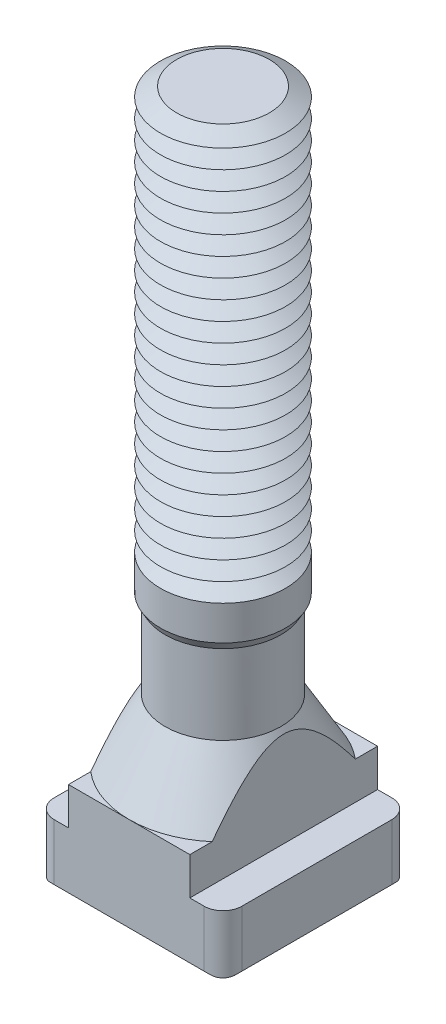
ISO-10303-21;
HEADER;
FILE_DESCRIPTION(('STEP AP214'),'2;1');
FILE_NAME('part.step','',(''),(''),'','','');
FILE_SCHEMA(('AUTOMOTIVE_DESIGN { 1 0 10303 214 1 1 1 1 }'));
ENDSEC;
DATA;
#1=APPLICATION_CONTEXT('core data for automotive mechanical design processes');
#2=APPLICATION_PROTOCOL_DEFINITION('international standard','automotive_design',2000,#1);
#3=PRODUCT_CONTEXT('',#1,'mechanical');
#4=PRODUCT('Part','Part','',(#3));
#5=PRODUCT_RELATED_PRODUCT_CATEGORY('part','',(#4));
#6=PRODUCT_DEFINITION_FORMATION('','',#4);
#7=PRODUCT_DEFINITION_CONTEXT('part definition',#1,'design');
#8=PRODUCT_DEFINITION('design','',#6,#7);
#9=PRODUCT_DEFINITION_SHAPE('','',#8);
#10=(LENGTH_UNIT() NAMED_UNIT(*) SI_UNIT(.MILLI.,.METRE.));
#11=(NAMED_UNIT(*) PLANE_ANGLE_UNIT() SI_UNIT($,.RADIAN.));
#12=(NAMED_UNIT(*) SI_UNIT($,.STERADIAN.) SOLID_ANGLE_UNIT());
#13=UNCERTAINTY_MEASURE_WITH_UNIT(LENGTH_MEASURE(1.E-05),#10,'distance_accuracy_value','');
#14=(GEOMETRIC_REPRESENTATION_CONTEXT(3) GLOBAL_UNCERTAINTY_ASSIGNED_CONTEXT((#13)) GLOBAL_UNIT_ASSIGNED_CONTEXT((#10,
#11,#12)) REPRESENTATION_CONTEXT('',''));
#15=CARTESIAN_POINT('',(0.,0.,0.));
#16=DIRECTION('',(0.,0.,1.));
#17=DIRECTION('',(1.,0.,0.));
#18=AXIS2_PLACEMENT_3D('',#15,#16,#17);
#19=CARTESIAN_POINT('',(0.,50.,0.));
#20=DIRECTION('',(0.,-1.,0.));
#21=DIRECTION('',(0.,0.,-1.));
#22=AXIS2_PLACEMENT_3D('',#19,#20,#21);
#23=CONICAL_SURFACE('',#22,3.70096189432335,1.0471975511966);
#24=CARTESIAN_POINT('',(0.,49.25,0.));
#25=DIRECTION('',(0.,-1.,0.));
#26=DIRECTION('',(0.,0.,-1.));
#27=AXIS2_PLACEMENT_3D('',#24,#25,#26);
#28=CIRCLE('',#27,5.00000000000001);
#29=CARTESIAN_POINT('',(0.,49.25,-5.00000000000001));
#30=VERTEX_POINT('',#29);
#31=EDGE_CURVE('E633',#30,#30,#28,.T.);
#32=ORIENTED_EDGE('',*,*,#31,.F.);
#33=EDGE_LOOP('',(#32));
#34=FACE_BOUND('',#33,.T.);
#35=CARTESIAN_POINT('',(0.,50.,0.));
#36=DIRECTION('',(0.,-1.,0.));
#37=DIRECTION('',(0.,0.,-1.));
#38=AXIS2_PLACEMENT_3D('',#35,#36,#37);
#39=CIRCLE('',#38,3.70096189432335);
#40=CARTESIAN_POINT('',(0.,50.,-3.70096189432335));
#41=VERTEX_POINT('',#40);
#42=EDGE_CURVE('E636',#41,#41,#39,.T.);
#43=ORIENTED_EDGE('',*,*,#42,.T.);
#44=EDGE_LOOP('',(#43));
#45=FACE_BOUND('',#44,.T.);
#46=ADVANCED_FACE('F39',(#34,#45),#23,.T.);
#47=CARTESIAN_POINT('',(0.,50.75,0.));
#48=DIRECTION('',(0.,1.,0.));
#49=DIRECTION('',(0.,0.,1.));
#50=AXIS2_PLACEMENT_3D('',#47,#48,#49);
#51=CONICAL_SURFACE('',#50,5.00000000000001,1.0471975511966);
#52=ORIENTED_EDGE('',*,*,#42,.F.);
#53=EDGE_LOOP('',(#52));
#54=FACE_BOUND('',#53,.T.);
#55=CARTESIAN_POINT('',(0.,50.75,0.));
#56=DIRECTION('',(0.,-1.,0.));
#57=DIRECTION('',(0.,0.,-1.));
#58=AXIS2_PLACEMENT_3D('',#55,#56,#57);
#59=CIRCLE('',#58,5.00000000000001);
#60=CARTESIAN_POINT('',(0.,50.75,-5.00000000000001));
#61=VERTEX_POINT('',#60);
#62=EDGE_CURVE('E789',#61,#61,#59,.T.);
#63=ORIENTED_EDGE('',*,*,#62,.T.);
#64=EDGE_LOOP('',(#63));
#65=FACE_BOUND('',#64,.T.);
#66=ADVANCED_FACE('F448',(#54,#65),#51,.T.);
#67=CARTESIAN_POINT('',(2.49728521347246,56.,0.));
#68=DIRECTION('',(0.,-1.,0.));
#69=DIRECTION('',(1.,0.,0.));
#70=AXIS2_PLACEMENT_3D('',#67,#68,#69);
#71=PLANE('',#70);
#72=CARTESIAN_POINT('',(0.,56.,0.));
#73=DIRECTION('',(0.,-1.,0.));
#74=DIRECTION('',(0.,0.,-1.));
#75=AXIS2_PLACEMENT_3D('',#72,#73,#74);
#76=CIRCLE('',#75,3.70096189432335);
#77=CARTESIAN_POINT('',(0.,56.,-3.70096189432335));
#78=VERTEX_POINT('',#77);
#79=EDGE_CURVE('E654',#78,#78,#76,.T.);
#80=ORIENTED_EDGE('',*,*,#79,.F.);
#81=EDGE_LOOP('',(#80));
#82=FACE_BOUND('',#81,.T.);
#83=ADVANCED_FACE('F454',(#82),#71,.F.);
#84=CARTESIAN_POINT('',(0.,56.,0.));
#85=DIRECTION('',(0.,-1.,0.));
#86=DIRECTION('',(0.,0.,-1.));
#87=AXIS2_PLACEMENT_3D('',#84,#85,#86);
#88=CONICAL_SURFACE('',#87,3.70096189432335,1.0471975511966);
#89=CARTESIAN_POINT('',(0.,55.25,0.));
#90=DIRECTION('',(0.,-1.,0.));
#91=DIRECTION('',(0.,0.,-1.));
#92=AXIS2_PLACEMENT_3D('',#89,#90,#91);
#93=CIRCLE('',#92,5.00000000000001);
#94=CARTESIAN_POINT('',(0.,55.25,-5.00000000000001));
#95=VERTEX_POINT('',#94);
#96=EDGE_CURVE('E651',#95,#95,#93,.T.);
#97=ORIENTED_EDGE('',*,*,#96,.F.);
#98=EDGE_LOOP('',(#97));
#99=FACE_BOUND('',#98,.T.);
#100=ORIENTED_EDGE('',*,*,#79,.T.);
#101=EDGE_LOOP('',(#100));
#102=FACE_BOUND('',#101,.T.);
#103=ADVANCED_FACE('F482',(#99,#102),#88,.T.);
#104=CARTESIAN_POINT('',(0.,55.25,0.));
#105=DIRECTION('',(0.,1.,0.));
#106=DIRECTION('',(0.,0.,1.));
#107=AXIS2_PLACEMENT_3D('',#104,#105,#106);
#108=CONICAL_SURFACE('',#107,5.00000000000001,1.0471975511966);
#109=CARTESIAN_POINT('',(0.,54.5,0.));
#110=DIRECTION('',(0.,-1.,0.));
#111=DIRECTION('',(0.,0.,-1.));
#112=AXIS2_PLACEMENT_3D('',#109,#110,#111);
#113=CIRCLE('',#112,3.70096189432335);
#114=CARTESIAN_POINT('',(0.,54.5,-3.70096189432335));
#115=VERTEX_POINT('',#114);
#116=EDGE_CURVE('E655',#115,#115,#113,.T.);
#117=ORIENTED_EDGE('',*,*,#116,.F.);
#118=EDGE_LOOP('',(#117));
#119=FACE_BOUND('',#118,.T.);
#120=ORIENTED_EDGE('',*,*,#96,.T.);
#121=EDGE_LOOP('',(#120));
#122=FACE_BOUND('',#121,.T.);
#123=ADVANCED_FACE('F479',(#119,#122),#108,.T.);
#124=CARTESIAN_POINT('',(0.,54.5,0.));
#125=DIRECTION('',(0.,-1.,0.));
#126=DIRECTION('',(0.,0.,-1.));
#127=AXIS2_PLACEMENT_3D('',#124,#125,#126);
#128=CONICAL_SURFACE('',#127,3.70096189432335,1.0471975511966);
#129=CARTESIAN_POINT('',(0.,53.75,0.));
#130=DIRECTION('',(0.,-1.,0.));
#131=DIRECTION('',(0.,0.,-1.));
#132=AXIS2_PLACEMENT_3D('',#129,#130,#131);
#133=CIRCLE('',#132,5.00000000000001);
#134=CARTESIAN_POINT('',(0.,53.75,-5.00000000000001));
#135=VERTEX_POINT('',#134);
#136=EDGE_CURVE('E659',#135,#135,#133,.T.);
#137=ORIENTED_EDGE('',*,*,#136,.F.);
#138=EDGE_LOOP('',(#137));
#139=FACE_BOUND('',#138,.T.);
#140=ORIENTED_EDGE('',*,*,#116,.T.);
#141=EDGE_LOOP('',(#140));
#142=FACE_BOUND('',#141,.T.);
#143=ADVANCED_FACE('F474',(#139,#142),#128,.T.);
#144=CARTESIAN_POINT('',(0.,53.75,0.));
#145=DIRECTION('',(0.,1.,0.));
#146=DIRECTION('',(0.,0.,1.));
#147=AXIS2_PLACEMENT_3D('',#144,#145,#146);
#148=CONICAL_SURFACE('',#147,5.00000000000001,1.0471975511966);
#149=CARTESIAN_POINT('',(0.,53.,0.));
#150=DIRECTION('',(0.,-1.,0.));
#151=DIRECTION('',(0.,0.,-1.));
#152=AXIS2_PLACEMENT_3D('',#149,#150,#151);
#153=CIRCLE('',#152,3.70096189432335);
#154=CARTESIAN_POINT('',(0.,53.,-3.70096189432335));
#155=VERTEX_POINT('',#154);
#156=EDGE_CURVE('E801',#155,#155,#153,.T.);
#157=ORIENTED_EDGE('',*,*,#156,.F.);
#158=EDGE_LOOP('',(#157));
#159=FACE_BOUND('',#158,.T.);
#160=ORIENTED_EDGE('',*,*,#136,.T.);
#161=EDGE_LOOP('',(#160));
#162=FACE_BOUND('',#161,.T.);
#163=ADVANCED_FACE('F471',(#159,#162),#148,.T.);
#164=CARTESIAN_POINT('',(0.,53.,0.));
#165=DIRECTION('',(0.,-1.,0.));
#166=DIRECTION('',(0.,0.,-1.));
#167=AXIS2_PLACEMENT_3D('',#164,#165,#166);
#168=CONICAL_SURFACE('',#167,3.70096189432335,1.0471975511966);
#169=CARTESIAN_POINT('',(0.,52.25,0.));
#170=DIRECTION('',(0.,-1.,0.));
#171=DIRECTION('',(0.,0.,-1.));
#172=AXIS2_PLACEMENT_3D('',#169,#170,#171);
#173=CIRCLE('',#172,5.00000000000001);
#174=CARTESIAN_POINT('',(0.,52.25,-5.00000000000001));
#175=VERTEX_POINT('',#174);
#176=EDGE_CURVE('E797',#175,#175,#173,.T.);
#177=ORIENTED_EDGE('',*,*,#176,.F.);
#178=EDGE_LOOP('',(#177));
#179=FACE_BOUND('',#178,.T.);
#180=ORIENTED_EDGE('',*,*,#156,.T.);
#181=EDGE_LOOP('',(#180));
#182=FACE_BOUND('',#181,.T.);
#183=ADVANCED_FACE('F465',(#179,#182),#168,.T.);
#184=CARTESIAN_POINT('',(0.,52.25,0.));
#185=DIRECTION('',(0.,1.,0.));
#186=DIRECTION('',(0.,0.,1.));
#187=AXIS2_PLACEMENT_3D('',#184,#185,#186);
#188=CONICAL_SURFACE('',#187,5.00000000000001,1.0471975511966);
#189=CARTESIAN_POINT('',(0.,51.5,0.));
#190=DIRECTION('',(0.,-1.,0.));
#191=DIRECTION('',(0.,0.,-1.));
#192=AXIS2_PLACEMENT_3D('',#189,#190,#191);
#193=CIRCLE('',#192,3.70096189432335);
#194=CARTESIAN_POINT('',(0.,51.5,-3.70096189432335));
#195=VERTEX_POINT('',#194);
#196=EDGE_CURVE('E793',#195,#195,#193,.T.);
#197=ORIENTED_EDGE('',*,*,#196,.F.);
#198=EDGE_LOOP('',(#197));
#199=FACE_BOUND('',#198,.T.);
#200=ORIENTED_EDGE('',*,*,#176,.T.);
#201=EDGE_LOOP('',(#200));
#202=FACE_BOUND('',#201,.T.);
#203=ADVANCED_FACE('F461',(#199,#202),#188,.T.);
#204=CARTESIAN_POINT('',(0.,51.5,0.));
#205=DIRECTION('',(0.,-1.,0.));
#206=DIRECTION('',(0.,0.,-1.));
#207=AXIS2_PLACEMENT_3D('',#204,#205,#206);
#208=CONICAL_SURFACE('',#207,3.70096189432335,1.0471975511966);
#209=ORIENTED_EDGE('',*,*,#62,.F.);
#210=EDGE_LOOP('',(#209));
#211=FACE_BOUND('',#210,.T.);
#212=ORIENTED_EDGE('',*,*,#196,.T.);
#213=EDGE_LOOP('',(#212));
#214=FACE_BOUND('',#213,.T.);
#215=ADVANCED_FACE('F464',(#211,#214),#208,.T.);
#216=CARTESIAN_POINT('',(0.,48.5,0.));
#217=DIRECTION('',(0.,-1.,0.));
#218=DIRECTION('',(0.,0.,-1.));
#219=AXIS2_PLACEMENT_3D('',#216,#217,#218);
#220=CONICAL_SURFACE('',#219,3.70096189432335,1.0471975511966);
#221=CARTESIAN_POINT('',(0.,47.75,0.));
#222=DIRECTION('',(0.,-1.,0.));
#223=DIRECTION('',(0.,0.,-1.));
#224=AXIS2_PLACEMENT_3D('',#221,#222,#223);
#225=CIRCLE('',#224,5.00000000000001);
#226=CARTESIAN_POINT('',(0.,47.75,-5.00000000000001));
#227=VERTEX_POINT('',#226);
#228=EDGE_CURVE('E674',#227,#227,#225,.T.);
#229=ORIENTED_EDGE('',*,*,#228,.F.);
#230=EDGE_LOOP('',(#229));
#231=FACE_BOUND('',#230,.T.);
#232=CARTESIAN_POINT('',(0.,48.5,0.));
#233=DIRECTION('',(0.,-1.,0.));
#234=DIRECTION('',(0.,0.,-1.));
#235=AXIS2_PLACEMENT_3D('',#232,#233,#234);
#236=CIRCLE('',#235,3.70096189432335);
#237=CARTESIAN_POINT('',(0.,48.5,-3.70096189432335));
#238=VERTEX_POINT('',#237);
#239=EDGE_CURVE('E637',#238,#238,#236,.T.);
#240=ORIENTED_EDGE('',*,*,#239,.T.);
#241=EDGE_LOOP('',(#240));
#242=FACE_BOUND('',#241,.T.);
#243=ADVANCED_FACE('F469',(#231,#242),#220,.T.);
#244=CARTESIAN_POINT('',(0.,49.25,0.));
#245=DIRECTION('',(0.,1.,0.));
#246=DIRECTION('',(0.,0.,1.));
#247=AXIS2_PLACEMENT_3D('',#244,#245,#246);
#248=CONICAL_SURFACE('',#247,5.00000000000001,1.0471975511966);
#249=ORIENTED_EDGE('',*,*,#239,.F.);
#250=EDGE_LOOP('',(#249));
#251=FACE_BOUND('',#250,.T.);
#252=ORIENTED_EDGE('',*,*,#31,.T.);
#253=EDGE_LOOP('',(#252));
#254=FACE_BOUND('',#253,.T.);
#255=ADVANCED_FACE('F1270',(#251,#254),#248,.T.);
#256=CARTESIAN_POINT('',(0.,47.,0.));
#257=DIRECTION('',(0.,-1.,0.));
#258=DIRECTION('',(0.,0.,-1.));
#259=AXIS2_PLACEMENT_3D('',#256,#257,#258);
#260=CONICAL_SURFACE('',#259,3.70096189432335,1.0471975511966);
#261=CARTESIAN_POINT('',(0.,46.25,0.));
#262=DIRECTION('',(0.,-1.,0.));
#263=DIRECTION('',(0.,0.,-1.));
#264=AXIS2_PLACEMENT_3D('',#261,#262,#263);
#265=CIRCLE('',#264,5.00000000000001);
#266=CARTESIAN_POINT('',(0.,46.25,-5.00000000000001));
#267=VERTEX_POINT('',#266);
#268=EDGE_CURVE('E675',#267,#267,#265,.T.);
#269=ORIENTED_EDGE('',*,*,#268,.F.);
#270=EDGE_LOOP('',(#269));
#271=FACE_BOUND('',#270,.T.);
#272=CARTESIAN_POINT('',(0.,47.,0.));
#273=DIRECTION('',(0.,-1.,0.));
#274=DIRECTION('',(0.,0.,-1.));
#275=AXIS2_PLACEMENT_3D('',#272,#273,#274);
#276=CIRCLE('',#275,3.70096189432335);
#277=CARTESIAN_POINT('',(0.,47.,-3.70096189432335));
#278=VERTEX_POINT('',#277);
#279=EDGE_CURVE('E671',#278,#278,#276,.T.);
#280=ORIENTED_EDGE('',*,*,#279,.T.);
#281=EDGE_LOOP('',(#280));
#282=FACE_BOUND('',#281,.T.);
#283=ADVANCED_FACE('F1260',(#271,#282),#260,.T.);
#284=CARTESIAN_POINT('',(0.,47.75,0.));
#285=DIRECTION('',(0.,1.,0.));
#286=DIRECTION('',(0.,0.,1.));
#287=AXIS2_PLACEMENT_3D('',#284,#285,#286);
#288=CONICAL_SURFACE('',#287,5.00000000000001,1.0471975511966);
#289=ORIENTED_EDGE('',*,*,#279,.F.);
#290=EDGE_LOOP('',(#289));
#291=FACE_BOUND('',#290,.T.);
#292=ORIENTED_EDGE('',*,*,#228,.T.);
#293=EDGE_LOOP('',(#292));
#294=FACE_BOUND('',#293,.T.);
#295=ADVANCED_FACE('F1250',(#291,#294),#288,.T.);
#296=CARTESIAN_POINT('',(0.,45.5,0.));
#297=DIRECTION('',(0.,-1.,0.));
#298=DIRECTION('',(0.,0.,-1.));
#299=AXIS2_PLACEMENT_3D('',#296,#297,#298);
#300=CONICAL_SURFACE('',#299,3.70096189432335,1.0471975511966);
#301=CARTESIAN_POINT('',(0.,44.75,0.));
#302=DIRECTION('',(0.,-1.,0.));
#303=DIRECTION('',(0.,0.,-1.));
#304=AXIS2_PLACEMENT_3D('',#301,#302,#303);
#305=CIRCLE('',#304,5.00000000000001);
#306=CARTESIAN_POINT('',(0.,44.75,-5.00000000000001));
#307=VERTEX_POINT('',#306);
#308=EDGE_CURVE('E639',#307,#307,#305,.T.);
#309=ORIENTED_EDGE('',*,*,#308,.F.);
#310=EDGE_LOOP('',(#309));
#311=FACE_BOUND('',#310,.T.);
#312=CARTESIAN_POINT('',(0.,45.5,0.));
#313=DIRECTION('',(0.,-1.,0.));
#314=DIRECTION('',(0.,0.,-1.));
#315=AXIS2_PLACEMENT_3D('',#312,#313,#314);
#316=CIRCLE('',#315,3.70096189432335);
#317=CARTESIAN_POINT('',(0.,45.5,-3.70096189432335));
#318=VERTEX_POINT('',#317);
#319=EDGE_CURVE('E642',#318,#318,#316,.T.);
#320=ORIENTED_EDGE('',*,*,#319,.T.);
#321=EDGE_LOOP('',(#320));
#322=FACE_BOUND('',#321,.T.);
#323=ADVANCED_FACE('F1240',(#311,#322),#300,.T.);
#324=CARTESIAN_POINT('',(0.,46.25,0.));
#325=DIRECTION('',(0.,1.,0.));
#326=DIRECTION('',(0.,0.,1.));
#327=AXIS2_PLACEMENT_3D('',#324,#325,#326);
#328=CONICAL_SURFACE('',#327,5.00000000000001,1.0471975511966);
#329=ORIENTED_EDGE('',*,*,#319,.F.);
#330=EDGE_LOOP('',(#329));
#331=FACE_BOUND('',#330,.T.);
#332=ORIENTED_EDGE('',*,*,#268,.T.);
#333=EDGE_LOOP('',(#332));
#334=FACE_BOUND('',#333,.T.);
#335=ADVANCED_FACE('F1230',(#331,#334),#328,.T.);
#336=CARTESIAN_POINT('',(0.,44.,0.));
#337=DIRECTION('',(0.,-1.,0.));
#338=DIRECTION('',(0.,0.,-1.));
#339=AXIS2_PLACEMENT_3D('',#336,#337,#338);
#340=CONICAL_SURFACE('',#339,3.70096189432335,1.0471975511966);
#341=CARTESIAN_POINT('',(0.,43.25,0.));
#342=DIRECTION('',(0.,-1.,0.));
#343=DIRECTION('',(0.,0.,-1.));
#344=AXIS2_PLACEMENT_3D('',#341,#342,#343);
#345=CIRCLE('',#344,5.00000000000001);
#346=CARTESIAN_POINT('',(0.,43.25,-5.00000000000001));
#347=VERTEX_POINT('',#346);
#348=EDGE_CURVE('E767',#347,#347,#345,.T.);
#349=ORIENTED_EDGE('',*,*,#348,.F.);
#350=EDGE_LOOP('',(#349));
#351=FACE_BOUND('',#350,.T.);
#352=CARTESIAN_POINT('',(0.,44.,0.));
#353=DIRECTION('',(0.,-1.,0.));
#354=DIRECTION('',(0.,0.,-1.));
#355=AXIS2_PLACEMENT_3D('',#352,#353,#354);
#356=CIRCLE('',#355,3.70096189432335);
#357=CARTESIAN_POINT('',(0.,44.,-3.70096189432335));
#358=VERTEX_POINT('',#357);
#359=EDGE_CURVE('E643',#358,#358,#356,.T.);
#360=ORIENTED_EDGE('',*,*,#359,.T.);
#361=EDGE_LOOP('',(#360));
#362=FACE_BOUND('',#361,.T.);
#363=ADVANCED_FACE('F1220',(#351,#362),#340,.T.);
#364=CARTESIAN_POINT('',(0.,44.75,0.));
#365=DIRECTION('',(0.,1.,0.));
#366=DIRECTION('',(0.,0.,1.));
#367=AXIS2_PLACEMENT_3D('',#364,#365,#366);
#368=CONICAL_SURFACE('',#367,5.00000000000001,1.0471975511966);
#369=ORIENTED_EDGE('',*,*,#359,.F.);
#370=EDGE_LOOP('',(#369));
#371=FACE_BOUND('',#370,.T.);
#372=ORIENTED_EDGE('',*,*,#308,.T.);
#373=EDGE_LOOP('',(#372));
#374=FACE_BOUND('',#373,.T.);
#375=ADVANCED_FACE('F1210',(#371,#374),#368,.T.);
#376=CARTESIAN_POINT('',(0.,42.5,0.));
#377=DIRECTION('',(0.,-1.,0.));
#378=DIRECTION('',(0.,0.,-1.));
#379=AXIS2_PLACEMENT_3D('',#376,#377,#378);
#380=CONICAL_SURFACE('',#379,3.70096189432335,1.0471975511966);
#381=CARTESIAN_POINT('',(0.,41.75,0.));
#382=DIRECTION('',(0.,-1.,0.));
#383=DIRECTION('',(0.,0.,-1.));
#384=AXIS2_PLACEMENT_3D('',#381,#382,#383);
#385=CIRCLE('',#384,5.00000000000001);
#386=CARTESIAN_POINT('',(0.,41.75,-5.00000000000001));
#387=VERTEX_POINT('',#386);
#388=EDGE_CURVE('E677',#387,#387,#385,.T.);
#389=ORIENTED_EDGE('',*,*,#388,.F.);
#390=EDGE_LOOP('',(#389));
#391=FACE_BOUND('',#390,.T.);
#392=CARTESIAN_POINT('',(0.,42.5,0.));
#393=DIRECTION('',(0.,-1.,0.));
#394=DIRECTION('',(0.,0.,-1.));
#395=AXIS2_PLACEMENT_3D('',#392,#393,#394);
#396=CIRCLE('',#395,3.70096189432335);
#397=CARTESIAN_POINT('',(0.,42.5,-3.70096189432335));
#398=VERTEX_POINT('',#397);
#399=EDGE_CURVE('E680',#398,#398,#396,.T.);
#400=ORIENTED_EDGE('',*,*,#399,.T.);
#401=EDGE_LOOP('',(#400));
#402=FACE_BOUND('',#401,.T.);
#403=ADVANCED_FACE('F1200',(#391,#402),#380,.T.);
#404=CARTESIAN_POINT('',(0.,43.25,0.));
#405=DIRECTION('',(0.,1.,0.));
#406=DIRECTION('',(0.,0.,1.));
#407=AXIS2_PLACEMENT_3D('',#404,#405,#406);
#408=CONICAL_SURFACE('',#407,5.00000000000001,1.0471975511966);
#409=ORIENTED_EDGE('',*,*,#399,.F.);
#410=EDGE_LOOP('',(#409));
#411=FACE_BOUND('',#410,.T.);
#412=ORIENTED_EDGE('',*,*,#348,.T.);
#413=EDGE_LOOP('',(#412));
#414=FACE_BOUND('',#413,.T.);
#415=ADVANCED_FACE('F1190',(#411,#414),#408,.T.);
#416=CARTESIAN_POINT('',(0.,41.,0.));
#417=DIRECTION('',(0.,-1.,0.));
#418=DIRECTION('',(0.,0.,-1.));
#419=AXIS2_PLACEMENT_3D('',#416,#417,#418);
#420=CONICAL_SURFACE('',#419,3.70096189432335,1.0471975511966);
#421=CARTESIAN_POINT('',(0.,40.25,0.));
#422=DIRECTION('',(0.,-1.,0.));
#423=DIRECTION('',(0.,0.,-1.));
#424=AXIS2_PLACEMENT_3D('',#421,#422,#423);
#425=CIRCLE('',#424,5.00000000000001);
#426=CARTESIAN_POINT('',(0.,40.25,-5.00000000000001));
#427=VERTEX_POINT('',#426);
#428=EDGE_CURVE('E683',#427,#427,#425,.T.);
#429=ORIENTED_EDGE('',*,*,#428,.F.);
#430=EDGE_LOOP('',(#429));
#431=FACE_BOUND('',#430,.T.);
#432=CARTESIAN_POINT('',(0.,41.,0.));
#433=DIRECTION('',(0.,-1.,0.));
#434=DIRECTION('',(0.,0.,-1.));
#435=AXIS2_PLACEMENT_3D('',#432,#433,#434);
#436=CIRCLE('',#435,3.70096189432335);
#437=CARTESIAN_POINT('',(0.,41.,-3.70096189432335));
#438=VERTEX_POINT('',#437);
#439=EDGE_CURVE('E681',#438,#438,#436,.T.);
#440=ORIENTED_EDGE('',*,*,#439,.T.);
#441=EDGE_LOOP('',(#440));
#442=FACE_BOUND('',#441,.T.);
#443=ADVANCED_FACE('F1180',(#431,#442),#420,.T.);
#444=CARTESIAN_POINT('',(0.,41.75,0.));
#445=DIRECTION('',(0.,1.,0.));
#446=DIRECTION('',(0.,0.,1.));
#447=AXIS2_PLACEMENT_3D('',#444,#445,#446);
#448=CONICAL_SURFACE('',#447,5.00000000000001,1.0471975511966);
#449=ORIENTED_EDGE('',*,*,#439,.F.);
#450=EDGE_LOOP('',(#449));
#451=FACE_BOUND('',#450,.T.);
#452=ORIENTED_EDGE('',*,*,#388,.T.);
#453=EDGE_LOOP('',(#452));
#454=FACE_BOUND('',#453,.T.);
#455=ADVANCED_FACE('F1170',(#451,#454),#448,.T.);
#456=CARTESIAN_POINT('',(0.,39.5,0.));
#457=DIRECTION('',(0.,-1.,0.));
#458=DIRECTION('',(0.,0.,-1.));
#459=AXIS2_PLACEMENT_3D('',#456,#457,#458);
#460=CONICAL_SURFACE('',#459,3.70096189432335,1.0471975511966);
#461=CARTESIAN_POINT('',(0.,38.75,0.));
#462=DIRECTION('',(0.,-1.,0.));
#463=DIRECTION('',(0.,0.,-1.));
#464=AXIS2_PLACEMENT_3D('',#461,#462,#463);
#465=CIRCLE('',#464,5.00000000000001);
#466=CARTESIAN_POINT('',(0.,38.75,-5.00000000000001));
#467=VERTEX_POINT('',#466);
#468=EDGE_CURVE('E754',#467,#467,#465,.T.);
#469=ORIENTED_EDGE('',*,*,#468,.F.);
#470=EDGE_LOOP('',(#469));
#471=FACE_BOUND('',#470,.T.);
#472=CARTESIAN_POINT('',(0.,39.5,0.));
#473=DIRECTION('',(0.,-1.,0.));
#474=DIRECTION('',(0.,0.,-1.));
#475=AXIS2_PLACEMENT_3D('',#472,#473,#474);
#476=CIRCLE('',#475,3.70096189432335);
#477=CARTESIAN_POINT('',(0.,39.5,-3.70096189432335));
#478=VERTEX_POINT('',#477);
#479=EDGE_CURVE('E686',#478,#478,#476,.T.);
#480=ORIENTED_EDGE('',*,*,#479,.T.);
#481=EDGE_LOOP('',(#480));
#482=FACE_BOUND('',#481,.T.);
#483=ADVANCED_FACE('F1160',(#471,#482),#460,.T.);
#484=CARTESIAN_POINT('',(0.,40.25,0.));
#485=DIRECTION('',(0.,1.,0.));
#486=DIRECTION('',(0.,0.,1.));
#487=AXIS2_PLACEMENT_3D('',#484,#485,#486);
#488=CONICAL_SURFACE('',#487,5.00000000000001,1.0471975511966);
#489=ORIENTED_EDGE('',*,*,#479,.F.);
#490=EDGE_LOOP('',(#489));
#491=FACE_BOUND('',#490,.T.);
#492=ORIENTED_EDGE('',*,*,#428,.T.);
#493=EDGE_LOOP('',(#492));
#494=FACE_BOUND('',#493,.T.);
#495=ADVANCED_FACE('F1150',(#491,#494),#488,.T.);
#496=CARTESIAN_POINT('',(0.,38.,0.));
#497=DIRECTION('',(0.,-1.,0.));
#498=DIRECTION('',(0.,0.,-1.));
#499=AXIS2_PLACEMENT_3D('',#496,#497,#498);
#500=CONICAL_SURFACE('',#499,3.70096189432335,1.0471975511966);
#501=CARTESIAN_POINT('',(0.,37.25,0.));
#502=DIRECTION('',(0.,-1.,0.));
#503=DIRECTION('',(0.,0.,-1.));
#504=AXIS2_PLACEMENT_3D('',#501,#502,#503);
#505=CIRCLE('',#504,5.00000000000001);
#506=CARTESIAN_POINT('',(0.,37.25,-5.00000000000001));
#507=VERTEX_POINT('',#506);
#508=EDGE_CURVE('E747',#507,#507,#505,.T.);
#509=ORIENTED_EDGE('',*,*,#508,.F.);
#510=EDGE_LOOP('',(#509));
#511=FACE_BOUND('',#510,.T.);
#512=CARTESIAN_POINT('',(0.,38.,0.));
#513=DIRECTION('',(0.,-1.,0.));
#514=DIRECTION('',(0.,0.,-1.));
#515=AXIS2_PLACEMENT_3D('',#512,#513,#514);
#516=CIRCLE('',#515,3.70096189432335);
#517=CARTESIAN_POINT('',(0.,38.,-3.70096189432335));
#518=VERTEX_POINT('',#517);
#519=EDGE_CURVE('E750',#518,#518,#516,.T.);
#520=ORIENTED_EDGE('',*,*,#519,.T.);
#521=EDGE_LOOP('',(#520));
#522=FACE_BOUND('',#521,.T.);
#523=ADVANCED_FACE('F1140',(#511,#522),#500,.T.);
#524=CARTESIAN_POINT('',(0.,38.75,0.));
#525=DIRECTION('',(0.,1.,0.));
#526=DIRECTION('',(0.,0.,1.));
#527=AXIS2_PLACEMENT_3D('',#524,#525,#526);
#528=CONICAL_SURFACE('',#527,5.00000000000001,1.0471975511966);
#529=ORIENTED_EDGE('',*,*,#519,.F.);
#530=EDGE_LOOP('',(#529));
#531=FACE_BOUND('',#530,.T.);
#532=ORIENTED_EDGE('',*,*,#468,.T.);
#533=EDGE_LOOP('',(#532));
#534=FACE_BOUND('',#533,.T.);
#535=ADVANCED_FACE('F1130',(#531,#534),#528,.T.);
#536=CARTESIAN_POINT('',(0.,36.5,0.));
#537=DIRECTION('',(0.,-1.,0.));
#538=DIRECTION('',(0.,0.,-1.));
#539=AXIS2_PLACEMENT_3D('',#536,#537,#538);
#540=CONICAL_SURFACE('',#539,3.70096189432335,1.0471975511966);
#541=CARTESIAN_POINT('',(0.,35.75,0.));
#542=DIRECTION('',(0.,-1.,0.));
#543=DIRECTION('',(0.,0.,-1.));
#544=AXIS2_PLACEMENT_3D('',#541,#542,#543);
#545=CIRCLE('',#544,5.00000000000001);
#546=CARTESIAN_POINT('',(0.,35.75,-5.00000000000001));
#547=VERTEX_POINT('',#546);
#548=EDGE_CURVE('E663',#547,#547,#545,.T.);
#549=ORIENTED_EDGE('',*,*,#548,.F.);
#550=EDGE_LOOP('',(#549));
#551=FACE_BOUND('',#550,.T.);
#552=CARTESIAN_POINT('',(0.,36.5,0.));
#553=DIRECTION('',(0.,-1.,0.));
#554=DIRECTION('',(0.,0.,-1.));
#555=AXIS2_PLACEMENT_3D('',#552,#553,#554);
#556=CIRCLE('',#555,3.70096189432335);
#557=CARTESIAN_POINT('',(0.,36.5,-3.70096189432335));
#558=VERTEX_POINT('',#557);
#559=EDGE_CURVE('E743',#558,#558,#556,.T.);
#560=ORIENTED_EDGE('',*,*,#559,.T.);
#561=EDGE_LOOP('',(#560));
#562=FACE_BOUND('',#561,.T.);
#563=ADVANCED_FACE('F1120',(#551,#562),#540,.T.);
#564=CARTESIAN_POINT('',(0.,37.25,0.));
#565=DIRECTION('',(0.,1.,0.));
#566=DIRECTION('',(0.,0.,1.));
#567=AXIS2_PLACEMENT_3D('',#564,#565,#566);
#568=CONICAL_SURFACE('',#567,5.00000000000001,1.0471975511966);
#569=ORIENTED_EDGE('',*,*,#559,.F.);
#570=EDGE_LOOP('',(#569));
#571=FACE_BOUND('',#570,.T.);
#572=ORIENTED_EDGE('',*,*,#508,.T.);
#573=EDGE_LOOP('',(#572));
#574=FACE_BOUND('',#573,.T.);
#575=ADVANCED_FACE('F1110',(#571,#574),#568,.T.);
#576=CARTESIAN_POINT('',(0.,35.,0.));
#577=DIRECTION('',(0.,-1.,0.));
#578=DIRECTION('',(0.,0.,-1.));
#579=AXIS2_PLACEMENT_3D('',#576,#577,#578);
#580=CONICAL_SURFACE('',#579,3.70096189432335,1.0471975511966);
#581=CARTESIAN_POINT('',(0.,34.25,0.));
#582=DIRECTION('',(0.,-1.,0.));
#583=DIRECTION('',(0.,0.,-1.));
#584=AXIS2_PLACEMENT_3D('',#581,#582,#583);
#585=CIRCLE('',#584,5.00000000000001);
#586=CARTESIAN_POINT('',(0.,34.25,-5.00000000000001));
#587=VERTEX_POINT('',#586);
#588=EDGE_CURVE('E664',#587,#587,#585,.T.);
#589=ORIENTED_EDGE('',*,*,#588,.F.);
#590=EDGE_LOOP('',(#589));
#591=FACE_BOUND('',#590,.T.);
#592=CARTESIAN_POINT('',(0.,35.,0.));
#593=DIRECTION('',(0.,-1.,0.));
#594=DIRECTION('',(0.,0.,-1.));
#595=AXIS2_PLACEMENT_3D('',#592,#593,#594);
#596=CIRCLE('',#595,3.70096189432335);
#597=CARTESIAN_POINT('',(0.,35.,-3.70096189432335));
#598=VERTEX_POINT('',#597);
#599=EDGE_CURVE('E661',#598,#598,#596,.T.);
#600=ORIENTED_EDGE('',*,*,#599,.T.);
#601=EDGE_LOOP('',(#600));
#602=FACE_BOUND('',#601,.T.);
#603=ADVANCED_FACE('F1100',(#591,#602),#580,.T.);
#604=CARTESIAN_POINT('',(0.,35.75,0.));
#605=DIRECTION('',(0.,1.,0.));
#606=DIRECTION('',(0.,0.,1.));
#607=AXIS2_PLACEMENT_3D('',#604,#605,#606);
#608=CONICAL_SURFACE('',#607,5.00000000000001,1.0471975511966);
#609=ORIENTED_EDGE('',*,*,#599,.F.);
#610=EDGE_LOOP('',(#609));
#611=FACE_BOUND('',#610,.T.);
#612=ORIENTED_EDGE('',*,*,#548,.T.);
#613=EDGE_LOOP('',(#612));
#614=FACE_BOUND('',#613,.T.);
#615=ADVANCED_FACE('F1090',(#611,#614),#608,.T.);
#616=CARTESIAN_POINT('',(0.,33.5,0.));
#617=DIRECTION('',(0.,-1.,0.));
#618=DIRECTION('',(0.,0.,-1.));
#619=AXIS2_PLACEMENT_3D('',#616,#617,#618);
#620=CONICAL_SURFACE('',#619,3.70096189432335,1.0471975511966);
#621=CARTESIAN_POINT('',(0.,32.75,0.));
#622=DIRECTION('',(0.,-1.,0.));
#623=DIRECTION('',(0.,0.,-1.));
#624=AXIS2_PLACEMENT_3D('',#621,#622,#623);
#625=CIRCLE('',#624,5.00000000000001);
#626=CARTESIAN_POINT('',(0.,32.75,-5.00000000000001));
#627=VERTEX_POINT('',#626);
#628=EDGE_CURVE('E729',#627,#627,#625,.T.);
#629=ORIENTED_EDGE('',*,*,#628,.F.);
#630=EDGE_LOOP('',(#629));
#631=FACE_BOUND('',#630,.T.);
#632=CARTESIAN_POINT('',(0.,33.5,0.));
#633=DIRECTION('',(0.,-1.,0.));
#634=DIRECTION('',(0.,0.,-1.));
#635=AXIS2_PLACEMENT_3D('',#632,#633,#634);
#636=CIRCLE('',#635,3.70096189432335);
#637=CARTESIAN_POINT('',(0.,33.5,-3.70096189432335));
#638=VERTEX_POINT('',#637);
#639=EDGE_CURVE('E733',#638,#638,#636,.T.);
#640=ORIENTED_EDGE('',*,*,#639,.T.);
#641=EDGE_LOOP('',(#640));
#642=FACE_BOUND('',#641,.T.);
#643=ADVANCED_FACE('F1080',(#631,#642),#620,.T.);
#644=CARTESIAN_POINT('',(0.,34.25,0.));
#645=DIRECTION('',(0.,1.,0.));
#646=DIRECTION('',(0.,0.,1.));
#647=AXIS2_PLACEMENT_3D('',#644,#645,#646);
#648=CONICAL_SURFACE('',#647,5.00000000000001,1.0471975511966);
#649=ORIENTED_EDGE('',*,*,#639,.F.);
#650=EDGE_LOOP('',(#649));
#651=FACE_BOUND('',#650,.T.);
#652=ORIENTED_EDGE('',*,*,#588,.T.);
#653=EDGE_LOOP('',(#652));
#654=FACE_BOUND('',#653,.T.);
#655=ADVANCED_FACE('F1070',(#651,#654),#648,.T.);
#656=CARTESIAN_POINT('',(0.,32.,0.));
#657=DIRECTION('',(0.,-1.,0.));
#658=DIRECTION('',(0.,0.,-1.));
#659=AXIS2_PLACEMENT_3D('',#656,#657,#658);
#660=CONICAL_SURFACE('',#659,3.70096189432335,1.0471975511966);
#661=CARTESIAN_POINT('',(0.,31.25,0.));
#662=DIRECTION('',(0.,-1.,0.));
#663=DIRECTION('',(0.,0.,-1.));
#664=AXIS2_PLACEMENT_3D('',#661,#662,#663);
#665=CIRCLE('',#664,5.00000000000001);
#666=CARTESIAN_POINT('',(0.,31.25,-5.00000000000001));
#667=VERTEX_POINT('',#666);
#668=EDGE_CURVE('E721',#667,#667,#665,.T.);
#669=ORIENTED_EDGE('',*,*,#668,.F.);
#670=EDGE_LOOP('',(#669));
#671=FACE_BOUND('',#670,.T.);
#672=CARTESIAN_POINT('',(0.,32.,0.));
#673=DIRECTION('',(0.,-1.,0.));
#674=DIRECTION('',(0.,0.,-1.));
#675=AXIS2_PLACEMENT_3D('',#672,#673,#674);
#676=CIRCLE('',#675,3.70096189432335);
#677=CARTESIAN_POINT('',(0.,32.,-3.70096189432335));
#678=VERTEX_POINT('',#677);
#679=EDGE_CURVE('E725',#678,#678,#676,.T.);
#680=ORIENTED_EDGE('',*,*,#679,.T.);
#681=EDGE_LOOP('',(#680));
#682=FACE_BOUND('',#681,.T.);
#683=ADVANCED_FACE('F1060',(#671,#682),#660,.T.);
#684=CARTESIAN_POINT('',(0.,32.75,0.));
#685=DIRECTION('',(0.,1.,0.));
#686=DIRECTION('',(0.,0.,1.));
#687=AXIS2_PLACEMENT_3D('',#684,#685,#686);
#688=CONICAL_SURFACE('',#687,5.00000000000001,1.0471975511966);
#689=ORIENTED_EDGE('',*,*,#679,.F.);
#690=EDGE_LOOP('',(#689));
#691=FACE_BOUND('',#690,.T.);
#692=ORIENTED_EDGE('',*,*,#628,.T.);
#693=EDGE_LOOP('',(#692));
#694=FACE_BOUND('',#693,.T.);
#695=ADVANCED_FACE('F1050',(#691,#694),#688,.T.);
#696=CARTESIAN_POINT('',(0.,30.5,0.));
#697=DIRECTION('',(0.,-1.,0.));
#698=DIRECTION('',(0.,0.,-1.));
#699=AXIS2_PLACEMENT_3D('',#696,#697,#698);
#700=CONICAL_SURFACE('',#699,3.70096189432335,1.0471975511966);
#701=CARTESIAN_POINT('',(0.,29.75,0.));
#702=DIRECTION('',(0.,-1.,0.));
#703=DIRECTION('',(0.,0.,-1.));
#704=AXIS2_PLACEMENT_3D('',#701,#702,#703);
#705=CIRCLE('',#704,5.00000000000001);
#706=CARTESIAN_POINT('',(0.,29.75,-5.00000000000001));
#707=VERTEX_POINT('',#706);
#708=EDGE_CURVE('E713',#707,#707,#705,.T.);
#709=ORIENTED_EDGE('',*,*,#708,.F.);
#710=EDGE_LOOP('',(#709));
#711=FACE_BOUND('',#710,.T.);
#712=CARTESIAN_POINT('',(0.,30.5,0.));
#713=DIRECTION('',(0.,-1.,0.));
#714=DIRECTION('',(0.,0.,-1.));
#715=AXIS2_PLACEMENT_3D('',#712,#713,#714);
#716=CIRCLE('',#715,3.70096189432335);
#717=CARTESIAN_POINT('',(0.,30.5,-3.70096189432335));
#718=VERTEX_POINT('',#717);
#719=EDGE_CURVE('E717',#718,#718,#716,.T.);
#720=ORIENTED_EDGE('',*,*,#719,.T.);
#721=EDGE_LOOP('',(#720));
#722=FACE_BOUND('',#721,.T.);
#723=ADVANCED_FACE('F1040',(#711,#722),#700,.T.);
#724=CARTESIAN_POINT('',(0.,31.25,0.));
#725=DIRECTION('',(0.,1.,0.));
#726=DIRECTION('',(0.,0.,1.));
#727=AXIS2_PLACEMENT_3D('',#724,#725,#726);
#728=CONICAL_SURFACE('',#727,5.00000000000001,1.0471975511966);
#729=ORIENTED_EDGE('',*,*,#719,.F.);
#730=EDGE_LOOP('',(#729));
#731=FACE_BOUND('',#730,.T.);
#732=ORIENTED_EDGE('',*,*,#668,.T.);
#733=EDGE_LOOP('',(#732));
#734=FACE_BOUND('',#733,.T.);
#735=ADVANCED_FACE('F1030',(#731,#734),#728,.T.);
#736=CARTESIAN_POINT('',(0.,29.,0.));
#737=DIRECTION('',(0.,-1.,0.));
#738=DIRECTION('',(0.,0.,-1.));
#739=AXIS2_PLACEMENT_3D('',#736,#737,#738);
#740=CONICAL_SURFACE('',#739,3.70096189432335,1.0471975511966);
#741=CARTESIAN_POINT('',(0.,28.25,0.));
#742=DIRECTION('',(0.,-1.,0.));
#743=DIRECTION('',(0.,0.,-1.));
#744=AXIS2_PLACEMENT_3D('',#741,#742,#743);
#745=CIRCLE('',#744,5.00000000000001);
#746=CARTESIAN_POINT('',(0.,28.25,-5.00000000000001));
#747=VERTEX_POINT('',#746);
#748=EDGE_CURVE('E705',#747,#747,#745,.T.);
#749=ORIENTED_EDGE('',*,*,#748,.F.);
#750=EDGE_LOOP('',(#749));
#751=FACE_BOUND('',#750,.T.);
#752=CARTESIAN_POINT('',(0.,29.,0.));
#753=DIRECTION('',(0.,-1.,0.));
#754=DIRECTION('',(0.,0.,-1.));
#755=AXIS2_PLACEMENT_3D('',#752,#753,#754);
#756=CIRCLE('',#755,3.70096189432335);
#757=CARTESIAN_POINT('',(0.,29.,-3.70096189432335));
#758=VERTEX_POINT('',#757);
#759=EDGE_CURVE('E709',#758,#758,#756,.T.);
#760=ORIENTED_EDGE('',*,*,#759,.T.);
#761=EDGE_LOOP('',(#760));
#762=FACE_BOUND('',#761,.T.);
#763=ADVANCED_FACE('F1020',(#751,#762),#740,.T.);
#764=CARTESIAN_POINT('',(0.,29.75,0.));
#765=DIRECTION('',(0.,1.,0.));
#766=DIRECTION('',(0.,0.,1.));
#767=AXIS2_PLACEMENT_3D('',#764,#765,#766);
#768=CONICAL_SURFACE('',#767,5.00000000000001,1.0471975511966);
#769=ORIENTED_EDGE('',*,*,#759,.F.);
#770=EDGE_LOOP('',(#769));
#771=FACE_BOUND('',#770,.T.);
#772=ORIENTED_EDGE('',*,*,#708,.T.);
#773=EDGE_LOOP('',(#772));
#774=FACE_BOUND('',#773,.T.);
#775=ADVANCED_FACE('F1010',(#771,#774),#768,.T.);
#776=CARTESIAN_POINT('',(0.,27.5,0.));
#777=DIRECTION('',(0.,-1.,0.));
#778=DIRECTION('',(0.,0.,-1.));
#779=AXIS2_PLACEMENT_3D('',#776,#777,#778);
#780=CONICAL_SURFACE('',#779,3.70096189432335,1.0471975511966);
#781=CARTESIAN_POINT('',(0.,26.75,0.));
#782=DIRECTION('',(0.,-1.,0.));
#783=DIRECTION('',(0.,0.,-1.));
#784=AXIS2_PLACEMENT_3D('',#781,#782,#783);
#785=CIRCLE('',#784,5.00000000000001);
#786=CARTESIAN_POINT('',(0.,26.75,-5.00000000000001));
#787=VERTEX_POINT('',#786);
#788=EDGE_CURVE('E645',#787,#787,#785,.T.);
#789=ORIENTED_EDGE('',*,*,#788,.F.);
#790=EDGE_LOOP('',(#789));
#791=FACE_BOUND('',#790,.T.);
#792=CARTESIAN_POINT('',(0.,27.5,0.));
#793=DIRECTION('',(0.,-1.,0.));
#794=DIRECTION('',(0.,0.,-1.));
#795=AXIS2_PLACEMENT_3D('',#792,#793,#794);
#796=CIRCLE('',#795,3.70096189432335);
#797=CARTESIAN_POINT('',(0.,27.5,-3.70096189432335));
#798=VERTEX_POINT('',#797);
#799=EDGE_CURVE('E647',#798,#798,#796,.T.);
#800=ORIENTED_EDGE('',*,*,#799,.T.);
#801=EDGE_LOOP('',(#800));
#802=FACE_BOUND('',#801,.T.);
#803=ADVANCED_FACE('F1000',(#791,#802),#780,.T.);
#804=CARTESIAN_POINT('',(0.,28.25,0.));
#805=DIRECTION('',(0.,1.,0.));
#806=DIRECTION('',(0.,0.,1.));
#807=AXIS2_PLACEMENT_3D('',#804,#805,#806);
#808=CONICAL_SURFACE('',#807,5.00000000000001,1.0471975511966);
#809=ORIENTED_EDGE('',*,*,#799,.F.);
#810=EDGE_LOOP('',(#809));
#811=FACE_BOUND('',#810,.T.);
#812=ORIENTED_EDGE('',*,*,#748,.T.);
#813=EDGE_LOOP('',(#812));
#814=FACE_BOUND('',#813,.T.);
#815=ADVANCED_FACE('F990',(#811,#814),#808,.T.);
#816=CARTESIAN_POINT('',(0.,26.,0.));
#817=DIRECTION('',(0.,-1.,0.));
#818=DIRECTION('',(0.,0.,-1.));
#819=AXIS2_PLACEMENT_3D('',#816,#817,#818);
#820=CONICAL_SURFACE('',#819,3.70096189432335,1.0471975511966);
#821=CARTESIAN_POINT('',(0.,25.25,0.));
#822=DIRECTION('',(0.,-1.,0.));
#823=DIRECTION('',(0.,0.,-1.));
#824=AXIS2_PLACEMENT_3D('',#821,#822,#823);
#825=CIRCLE('',#824,5.00000000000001);
#826=CARTESIAN_POINT('',(0.,25.25,-5.00000000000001));
#827=VERTEX_POINT('',#826);
#828=EDGE_CURVE('E690',#827,#827,#825,.T.);
#829=ORIENTED_EDGE('',*,*,#828,.F.);
#830=EDGE_LOOP('',(#829));
#831=FACE_BOUND('',#830,.T.);
#832=CARTESIAN_POINT('',(0.,26.,0.));
#833=DIRECTION('',(0.,-1.,0.));
#834=DIRECTION('',(0.,0.,-1.));
#835=AXIS2_PLACEMENT_3D('',#832,#833,#834);
#836=CIRCLE('',#835,3.70096189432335);
#837=CARTESIAN_POINT('',(0.,26.,-3.70096189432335));
#838=VERTEX_POINT('',#837);
#839=EDGE_CURVE('E648',#838,#838,#836,.T.);
#840=ORIENTED_EDGE('',*,*,#839,.T.);
#841=EDGE_LOOP('',(#840));
#842=FACE_BOUND('',#841,.T.);
#843=ADVANCED_FACE('F980',(#831,#842),#820,.T.);
#844=CARTESIAN_POINT('',(0.,26.75,0.));
#845=DIRECTION('',(0.,1.,0.));
#846=DIRECTION('',(0.,0.,1.));
#847=AXIS2_PLACEMENT_3D('',#844,#845,#846);
#848=CONICAL_SURFACE('',#847,5.00000000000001,1.0471975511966);
#849=ORIENTED_EDGE('',*,*,#839,.F.);
#850=EDGE_LOOP('',(#849));
#851=FACE_BOUND('',#850,.T.);
#852=ORIENTED_EDGE('',*,*,#788,.T.);
#853=EDGE_LOOP('',(#852));
#854=FACE_BOUND('',#853,.T.);
#855=ADVANCED_FACE('F970',(#851,#854),#848,.T.);
#856=CARTESIAN_POINT('',(0.,24.5,0.));
#857=DIRECTION('',(0.,-1.,0.));
#858=DIRECTION('',(0.,0.,-1.));
#859=AXIS2_PLACEMENT_3D('',#856,#857,#858);
#860=CONICAL_SURFACE('',#859,3.70096189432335,1.0471975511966);
#861=CARTESIAN_POINT('',(0.,23.75,0.));
#862=DIRECTION('',(0.,-1.,0.));
#863=DIRECTION('',(0.,0.,-1.));
#864=AXIS2_PLACEMENT_3D('',#861,#862,#863);
#865=CIRCLE('',#864,5.00000000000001);
#866=CARTESIAN_POINT('',(0.,23.75,-5.00000000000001));
#867=VERTEX_POINT('',#866);
#868=EDGE_CURVE('E688',#867,#867,#865,.T.);
#869=ORIENTED_EDGE('',*,*,#868,.F.);
#870=EDGE_LOOP('',(#869));
#871=FACE_BOUND('',#870,.T.);
#872=CARTESIAN_POINT('',(0.,24.5,0.));
#873=DIRECTION('',(0.,-1.,0.));
#874=DIRECTION('',(0.,0.,-1.));
#875=AXIS2_PLACEMENT_3D('',#872,#873,#874);
#876=CIRCLE('',#875,3.70096189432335);
#877=CARTESIAN_POINT('',(0.,24.5,-3.70096189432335));
#878=VERTEX_POINT('',#877);
#879=EDGE_CURVE('E698',#878,#878,#876,.T.);
#880=ORIENTED_EDGE('',*,*,#879,.T.);
#881=EDGE_LOOP('',(#880));
#882=FACE_BOUND('',#881,.T.);
#883=ADVANCED_FACE('F566',(#871,#882),#860,.T.);
#884=CARTESIAN_POINT('',(0.,25.25,0.));
#885=DIRECTION('',(0.,1.,0.));
#886=DIRECTION('',(0.,0.,1.));
#887=AXIS2_PLACEMENT_3D('',#884,#885,#886);
#888=CONICAL_SURFACE('',#887,5.00000000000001,1.0471975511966);
#889=ORIENTED_EDGE('',*,*,#879,.F.);
#890=EDGE_LOOP('',(#889));
#891=FACE_BOUND('',#890,.T.);
#892=ORIENTED_EDGE('',*,*,#828,.T.);
#893=EDGE_LOOP('',(#892));
#894=FACE_BOUND('',#893,.T.);
#895=ADVANCED_FACE('F561',(#891,#894),#888,.T.);
#896=CARTESIAN_POINT('',(-6.79289321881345,2.9142135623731,-6.79289321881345));
#897=DIRECTION('',(-0.577350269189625,0.577350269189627,-0.577350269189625));
#898=DIRECTION('',(0.,0.707106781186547,0.707106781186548));
#899=AXIS2_PLACEMENT_3D('',#896,#897,#898);
#900=CYLINDRICAL_SURFACE('',#899,1.5);
#901=CARTESIAN_POINT('',(-3.87867965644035,0.,-3.87867965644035));
#902=DIRECTION('',(0.,1.,0.));
#903=DIRECTION('',(-0.707106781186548,0.,-0.707106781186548));
#904=AXIS2_PLACEMENT_3D('',#901,#902,#903);
#905=ELLIPSE('',#904,2.59807621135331,1.5);
#906=CARTESIAN_POINT('',(-5.99999999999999,0.,-4.93933982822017));
#907=VERTEX_POINT('',#906);
#908=CARTESIAN_POINT('',(-4.93933982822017,0.,-5.99999999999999));
#909=VERTEX_POINT('',#908);
#910=EDGE_CURVE('E325',#907,#909,#905,.F.);
#911=ORIENTED_EDGE('',*,*,#910,.F.);
#912=DIRECTION('',(0.577350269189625,-0.577350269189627,0.577350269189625));
#913=VECTOR('',#912,1.);
#914=CARTESIAN_POINT('',(-2.85355339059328,-3.14644660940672,-1.79289321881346));
#915=LINE('',#914,#913);
#916=CARTESIAN_POINT('',(-7.4488887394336,1.44888873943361,-6.38822856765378));
#917=VERTEX_POINT('',#916);
#918=EDGE_CURVE('E366',#917,#907,#915,.T.);
#919=ORIENTED_EDGE('',*,*,#918,.F.);
#920=CARTESIAN_POINT('',(-6.,2.12132034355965,-6.));
#921=DIRECTION('',(0.325057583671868,-0.888073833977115,0.325057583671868));
#922=DIRECTION('',(-0.627963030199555,-0.459700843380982,-0.627963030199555));
#923=AXIS2_PLACEMENT_3D('',#920,#921,#922);
#924=ELLIPSE('',#923,1.68904875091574,1.5);
#925=CARTESIAN_POINT('',(-6.38822856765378,1.44888873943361,-7.4488887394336));
#926=VERTEX_POINT('',#925);
#927=EDGE_CURVE('E263',#917,#926,#924,.T.);
#928=ORIENTED_EDGE('',*,*,#927,.T.);
#929=DIRECTION('',(0.577350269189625,-0.577350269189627,0.577350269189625));
#930=VECTOR('',#929,1.);
#931=CARTESIAN_POINT('',(-6.79289321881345,1.85355339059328,-7.85355339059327));
#932=LINE('',#931,#930);
#933=EDGE_CURVE('E359',#909,#926,#932,.F.);
#934=ORIENTED_EDGE('',*,*,#933,.F.);
#935=EDGE_LOOP('',(#911,#919,#928,#934));
#936=FACE_BOUND('',#935,.T.);
#937=ADVANCED_FACE('F550',(#936),#900,.T.);
#938=CARTESIAN_POINT('',(1.79289321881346,-2.0857864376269,-1.79289321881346));
#939=DIRECTION('',(0.577350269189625,0.577350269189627,-0.577350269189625));
#940=DIRECTION('',(0.,0.707106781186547,0.707106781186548));
#941=AXIS2_PLACEMENT_3D('',#938,#939,#940);
#942=CYLINDRICAL_SURFACE('',#941,1.5);
#943=CARTESIAN_POINT('',(3.87867965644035,0.,-3.87867965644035));
#944=DIRECTION('',(0.,1.,0.));
#945=DIRECTION('',(0.707106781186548,0.,-0.707106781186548));
#946=AXIS2_PLACEMENT_3D('',#943,#944,#945);
#947=ELLIPSE('',#946,2.59807621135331,1.5);
#948=CARTESIAN_POINT('',(4.93933982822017,0.,-5.99999999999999));
#949=VERTEX_POINT('',#948);
#950=CARTESIAN_POINT('',(5.99999999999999,0.,-4.93933982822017));
#951=VERTEX_POINT('',#950);
#952=EDGE_CURVE('E331',#949,#951,#947,.F.);
#953=ORIENTED_EDGE('',*,*,#952,.F.);
#954=DIRECTION('',(-0.577350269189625,-0.577350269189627,0.577350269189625));
#955=VECTOR('',#954,1.);
#956=CARTESIAN_POINT('',(1.79289321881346,-3.14644660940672,-2.85355339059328));
#957=LINE('',#956,#955);
#958=CARTESIAN_POINT('',(6.38822856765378,1.44888873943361,-7.4488887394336));
#959=VERTEX_POINT('',#958);
#960=EDGE_CURVE('E353',#959,#949,#957,.T.);
#961=ORIENTED_EDGE('',*,*,#960,.F.);
#962=CARTESIAN_POINT('',(6.,2.12132034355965,-6.));
#963=DIRECTION('',(-0.325057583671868,-0.888073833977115,0.325057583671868));
#964=DIRECTION('',(0.627963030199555,-0.459700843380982,-0.627963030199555));
#965=AXIS2_PLACEMENT_3D('',#962,#963,#964);
#966=ELLIPSE('',#965,1.68904875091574,1.5);
#967=CARTESIAN_POINT('',(7.4488887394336,1.44888873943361,-6.38822856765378));
#968=VERTEX_POINT('',#967);
#969=EDGE_CURVE('E406',#959,#968,#966,.T.);
#970=ORIENTED_EDGE('',*,*,#969,.T.);
#971=DIRECTION('',(-0.577350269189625,-0.577350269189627,0.577350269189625));
#972=VECTOR('',#971,1.);
#973=CARTESIAN_POINT('',(2.85355339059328,-3.14644660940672,-1.79289321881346));
#974=LINE('',#973,#972);
#975=EDGE_CURVE('E321',#951,#968,#974,.F.);
#976=ORIENTED_EDGE('',*,*,#975,.F.);
#977=EDGE_LOOP('',(#953,#961,#970,#976));
#978=FACE_BOUND('',#977,.T.);
#979=ADVANCED_FACE('F546',(#978),#942,.T.);
#980=CARTESIAN_POINT('',(7.5,0.,-7.5));
#981=DIRECTION('',(0.,1.,0.));
#982=DIRECTION('',(0.,0.,1.));
#983=AXIS2_PLACEMENT_3D('',#980,#981,#982);
#984=PLANE('',#983);
#985=DIRECTION('',(0.,0.,1.));
#986=VECTOR('',#985,1.);
#987=CARTESIAN_POINT('',(5.99999999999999,0.,-7.5));
#988=LINE('',#987,#986);
#989=CARTESIAN_POINT('',(5.99999999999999,0.,4.93933982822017));
#990=VERTEX_POINT('',#989);
#991=EDGE_CURVE('E295',#951,#990,#988,.T.);
#992=ORIENTED_EDGE('',*,*,#991,.T.);
#993=CARTESIAN_POINT('',(3.87867965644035,0.,3.87867965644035));
#994=DIRECTION('',(0.,1.,0.));
#995=DIRECTION('',(-0.707106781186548,0.,-0.707106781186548));
#996=AXIS2_PLACEMENT_3D('',#993,#994,#995);
#997=ELLIPSE('',#996,2.59807621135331,1.5);
#998=CARTESIAN_POINT('',(4.93933982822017,0.,5.99999999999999));
#999=VERTEX_POINT('',#998);
#1000=EDGE_CURVE('E334',#990,#999,#997,.F.);
#1001=ORIENTED_EDGE('',*,*,#1000,.T.);
#1002=DIRECTION('',(-1.,0.,0.));
#1003=VECTOR('',#1002,1.);
#1004=CARTESIAN_POINT('',(7.5,0.,5.99999999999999));
#1005=LINE('',#1004,#1003);
#1006=CARTESIAN_POINT('',(-4.93933982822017,0.,5.99999999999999));
#1007=VERTEX_POINT('',#1006);
#1008=EDGE_CURVE('E282',#999,#1007,#1005,.T.);
#1009=ORIENTED_EDGE('',*,*,#1008,.T.);
#1010=CARTESIAN_POINT('',(-3.87867965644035,0.,3.87867965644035));
#1011=DIRECTION('',(0.,1.,0.));
#1012=DIRECTION('',(0.707106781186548,0.,-0.707106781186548));
#1013=AXIS2_PLACEMENT_3D('',#1010,#1011,#1012);
#1014=ELLIPSE('',#1013,2.59807621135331,1.5);
#1015=CARTESIAN_POINT('',(-5.99999999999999,0.,4.93933982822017));
#1016=VERTEX_POINT('',#1015);
#1017=EDGE_CURVE('E328',#1007,#1016,#1014,.F.);
#1018=ORIENTED_EDGE('',*,*,#1017,.T.);
#1019=DIRECTION('',(0.,0.,-1.));
#1020=VECTOR('',#1019,1.);
#1021=CARTESIAN_POINT('',(-5.99999999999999,0.,-7.5));
#1022=LINE('',#1021,#1020);
#1023=EDGE_CURVE('E287',#1016,#907,#1022,.T.);
#1024=ORIENTED_EDGE('',*,*,#1023,.T.);
#1025=ORIENTED_EDGE('',*,*,#910,.T.);
#1026=DIRECTION('',(1.,0.,0.));
#1027=VECTOR('',#1026,1.);
#1028=CARTESIAN_POINT('',(7.5,0.,-5.99999999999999));
#1029=LINE('',#1028,#1027);
#1030=EDGE_CURVE('E291',#909,#949,#1029,.T.);
#1031=ORIENTED_EDGE('',*,*,#1030,.T.);
#1032=ORIENTED_EDGE('',*,*,#952,.T.);
#1033=EDGE_LOOP('',(#992,#1001,#1009,#1018,#1024,#1025,#1031,#1032));
#1034=FACE_BOUND('',#1033,.T.);
#1035=ADVANCED_FACE('F549',(#1034),#984,.F.);
#1036=CARTESIAN_POINT('',(-6.79289321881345,2.9142135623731,6.79289321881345));
#1037=DIRECTION('',(0.577350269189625,-0.577350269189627,-0.577350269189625));
#1038=DIRECTION('',(0.,0.707106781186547,-0.707106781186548));
#1039=AXIS2_PLACEMENT_3D('',#1036,#1037,#1038);
#1040=CYLINDRICAL_SURFACE('',#1039,1.5);
#1041=CARTESIAN_POINT('',(-6.,2.12132034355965,6.));
#1042=DIRECTION('',(0.325057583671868,-0.888073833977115,-0.325057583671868));
#1043=DIRECTION('',(-0.627963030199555,-0.459700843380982,0.627963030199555));
#1044=AXIS2_PLACEMENT_3D('',#1041,#1042,#1043);
#1045=ELLIPSE('',#1044,1.68904875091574,1.5);
#1046=CARTESIAN_POINT('',(-6.38822856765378,1.44888873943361,7.4488887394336));
#1047=VERTEX_POINT('',#1046);
#1048=CARTESIAN_POINT('',(-7.4488887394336,1.44888873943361,6.38822856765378));
#1049=VERTEX_POINT('',#1048);
#1050=EDGE_CURVE('E409',#1047,#1049,#1045,.T.);
#1051=ORIENTED_EDGE('',*,*,#1050,.T.);
#1052=DIRECTION('',(-0.577350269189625,0.577350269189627,0.577350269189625));
#1053=VECTOR('',#1052,1.);
#1054=CARTESIAN_POINT('',(-7.85355339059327,1.85355339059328,6.79289321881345));
#1055=LINE('',#1054,#1053);
#1056=EDGE_CURVE('E372',#1016,#1049,#1055,.T.);
#1057=ORIENTED_EDGE('',*,*,#1056,.F.);
#1058=ORIENTED_EDGE('',*,*,#1017,.F.);
#1059=DIRECTION('',(-0.577350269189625,0.577350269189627,0.577350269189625));
#1060=VECTOR('',#1059,1.);
#1061=CARTESIAN_POINT('',(-6.79289321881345,1.85355339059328,7.85355339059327));
#1062=LINE('',#1061,#1060);
#1063=EDGE_CURVE('E346',#1047,#1007,#1062,.F.);
#1064=ORIENTED_EDGE('',*,*,#1063,.F.);
#1065=EDGE_LOOP('',(#1051,#1057,#1058,#1064));
#1066=FACE_BOUND('',#1065,.T.);
#1067=ADVANCED_FACE('F541',(#1066),#1040,.T.);
#1068=CARTESIAN_POINT('',(-7.5,1.50000000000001,7.5));
#1069=DIRECTION('',(0.707106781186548,0.707106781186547,0.));
#1070=DIRECTION('',(-0.707106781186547,0.707106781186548,0.));
#1071=AXIS2_PLACEMENT_3D('',#1068,#1069,#1070);
#1072=PLANE('',#1071);
#1073=ORIENTED_EDGE('',*,*,#1023,.F.);
#1074=ORIENTED_EDGE('',*,*,#1056,.T.);
#1075=CARTESIAN_POINT('',(-6.,0.,6.));
#1076=DIRECTION('',(0.707106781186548,0.707106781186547,0.));
#1077=DIRECTION('',(0.707106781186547,-0.707106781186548,0.));
#1078=AXIS2_PLACEMENT_3D('',#1075,#1076,#1077);
#1079=ELLIPSE('',#1078,2.12132034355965,1.5);
#1080=CARTESIAN_POINT('',(-7.5,1.50000000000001,6.));
#1081=VERTEX_POINT('',#1080);
#1082=EDGE_CURVE('E369',#1049,#1081,#1079,.F.);
#1083=ORIENTED_EDGE('',*,*,#1082,.T.);
#1084=DIRECTION('',(0.,0.,1.));
#1085=VECTOR('',#1084,1.);
#1086=CARTESIAN_POINT('',(-7.5,1.50000000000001,7.5));
#1087=LINE('',#1086,#1085);
#1088=CARTESIAN_POINT('',(-7.5,1.50000000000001,-6.));
#1089=VERTEX_POINT('',#1088);
#1090=EDGE_CURVE('E303',#1089,#1081,#1087,.T.);
#1091=ORIENTED_EDGE('',*,*,#1090,.F.);
#1092=CARTESIAN_POINT('',(-6.,0.,-6.));
#1093=DIRECTION('',(0.707106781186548,0.707106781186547,0.));
#1094=DIRECTION('',(0.707106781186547,-0.707106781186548,0.));
#1095=AXIS2_PLACEMENT_3D('',#1092,#1093,#1094);
#1096=ELLIPSE('',#1095,2.12132034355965,1.5);
#1097=EDGE_CURVE('E363',#1089,#917,#1096,.F.);
#1098=ORIENTED_EDGE('',*,*,#1097,.T.);
#1099=ORIENTED_EDGE('',*,*,#918,.T.);
#1100=EDGE_LOOP('',(#1073,#1074,#1083,#1091,#1098,#1099));
#1101=FACE_BOUND('',#1100,.T.);
#1102=ADVANCED_FACE('F528',(#1101),#1072,.F.);
#1103=CARTESIAN_POINT('',(7.5,1.50000000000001,7.5));
#1104=DIRECTION('',(-0.707106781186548,0.707106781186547,0.));
#1105=DIRECTION('',(-0.707106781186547,-0.707106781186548,0.));
#1106=AXIS2_PLACEMENT_3D('',#1103,#1104,#1105);
#1107=PLANE('',#1106);
#1108=ORIENTED_EDGE('',*,*,#991,.F.);
#1109=ORIENTED_EDGE('',*,*,#975,.T.);
#1110=CARTESIAN_POINT('',(6.,0.,-6.));
#1111=DIRECTION('',(-0.707106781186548,0.707106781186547,0.));
#1112=DIRECTION('',(-0.707106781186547,-0.707106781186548,0.));
#1113=AXIS2_PLACEMENT_3D('',#1110,#1111,#1112);
#1114=ELLIPSE('',#1113,2.12132034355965,1.5);
#1115=CARTESIAN_POINT('',(7.5,1.50000000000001,-6.));
#1116=VERTEX_POINT('',#1115);
#1117=EDGE_CURVE('E318',#968,#1116,#1114,.F.);
#1118=ORIENTED_EDGE('',*,*,#1117,.T.);
#1119=DIRECTION('',(0.,0.,-1.));
#1120=VECTOR('',#1119,1.);
#1121=CARTESIAN_POINT('',(7.5,1.50000000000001,7.5));
#1122=LINE('',#1121,#1120);
#1123=CARTESIAN_POINT('',(7.5,1.50000000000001,6.));
#1124=VERTEX_POINT('',#1123);
#1125=EDGE_CURVE('E278',#1124,#1116,#1122,.T.);
#1126=ORIENTED_EDGE('',*,*,#1125,.F.);
#1127=CARTESIAN_POINT('',(6.,0.,6.));
#1128=DIRECTION('',(-0.707106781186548,0.707106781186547,0.));
#1129=DIRECTION('',(-0.707106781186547,-0.707106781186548,0.));
#1130=AXIS2_PLACEMENT_3D('',#1127,#1128,#1129);
#1131=ELLIPSE('',#1130,2.12132034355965,1.5);
#1132=CARTESIAN_POINT('',(7.4488887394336,1.44888873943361,6.38822856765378));
#1133=VERTEX_POINT('',#1132);
#1134=EDGE_CURVE('E311',#1124,#1133,#1131,.F.);
#1135=ORIENTED_EDGE('',*,*,#1134,.T.);
#1136=DIRECTION('',(0.577350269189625,0.577350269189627,0.577350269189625));
#1137=VECTOR('',#1136,1.);
#1138=CARTESIAN_POINT('',(7.85355339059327,1.85355339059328,6.79289321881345));
#1139=LINE('',#1138,#1137);
#1140=EDGE_CURVE('E314',#1133,#990,#1139,.F.);
#1141=ORIENTED_EDGE('',*,*,#1140,.T.);
#1142=EDGE_LOOP('',(#1108,#1109,#1118,#1126,#1135,#1141));
#1143=FACE_BOUND('',#1142,.T.);
#1144=ADVANCED_FACE('F525',(#1143),#1107,.F.);
#1145=CARTESIAN_POINT('',(6.79289321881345,2.9142135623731,6.79289321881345));
#1146=DIRECTION('',(-0.577350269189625,-0.577350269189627,-0.577350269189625));
#1147=DIRECTION('',(0.,0.707106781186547,-0.707106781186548));
#1148=AXIS2_PLACEMENT_3D('',#1145,#1146,#1147);
#1149=CYLINDRICAL_SURFACE('',#1148,1.5);
#1150=CARTESIAN_POINT('',(6.,2.12132034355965,6.));
#1151=DIRECTION('',(-0.325057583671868,-0.888073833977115,-0.325057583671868));
#1152=DIRECTION('',(0.627963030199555,-0.459700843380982,0.627963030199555));
#1153=AXIS2_PLACEMENT_3D('',#1150,#1151,#1152);
#1154=ELLIPSE('',#1153,1.68904875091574,1.5);
#1155=CARTESIAN_POINT('',(6.38822856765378,1.44888873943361,7.4488887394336));
#1156=VERTEX_POINT('',#1155);
#1157=EDGE_CURVE('E268',#1133,#1156,#1154,.T.);
#1158=ORIENTED_EDGE('',*,*,#1157,.T.);
#1159=DIRECTION('',(0.577350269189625,0.577350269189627,0.577350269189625));
#1160=VECTOR('',#1159,1.);
#1161=CARTESIAN_POINT('',(1.79289321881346,-3.14644660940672,2.85355339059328));
#1162=LINE('',#1161,#1160);
#1163=EDGE_CURVE('E340',#999,#1156,#1162,.T.);
#1164=ORIENTED_EDGE('',*,*,#1163,.F.);
#1165=ORIENTED_EDGE('',*,*,#1000,.F.);
#1166=ORIENTED_EDGE('',*,*,#1140,.F.);
#1167=EDGE_LOOP('',(#1158,#1164,#1165,#1166));
#1168=FACE_BOUND('',#1167,.T.);
#1169=ADVANCED_FACE('F522',(#1168),#1149,.T.);
#1170=CARTESIAN_POINT('',(-7.5,9.,7.5));
#1171=DIRECTION('',(1.,0.,0.));
#1172=DIRECTION('',(0.,0.,-1.));
#1173=AXIS2_PLACEMENT_3D('',#1170,#1171,#1172);
#1174=PLANE('',#1173);
#1175=DIRECTION('',(0.,-1.,0.));
#1176=VECTOR('',#1175,1.);
#1177=CARTESIAN_POINT('',(-7.5,9.,6.));
#1178=LINE('',#1177,#1176);
#1179=CARTESIAN_POINT('',(-7.5,6.,6.));
#1180=VERTEX_POINT('',#1179);
#1181=EDGE_CURVE('E385',#1081,#1180,#1178,.F.);
#1182=ORIENTED_EDGE('',*,*,#1181,.T.);
#1183=DIRECTION('',(0.,0.,-1.));
#1184=VECTOR('',#1183,1.);
#1185=CARTESIAN_POINT('',(-7.5,6.,7.5));
#1186=LINE('',#1185,#1184);
#1187=CARTESIAN_POINT('',(-7.5,6.,-6.));
#1188=VERTEX_POINT('',#1187);
#1189=EDGE_CURVE('E231',#1180,#1188,#1186,.T.);
#1190=ORIENTED_EDGE('',*,*,#1189,.T.);
#1191=DIRECTION('',(0.,-1.,0.));
#1192=VECTOR('',#1191,1.);
#1193=CARTESIAN_POINT('',(-7.5,9.,-6.));
#1194=LINE('',#1193,#1192);
#1195=EDGE_CURVE('E382',#1188,#1089,#1194,.T.);
#1196=ORIENTED_EDGE('',*,*,#1195,.T.);
#1197=ORIENTED_EDGE('',*,*,#1090,.T.);
#1198=EDGE_LOOP('',(#1182,#1190,#1196,#1197));
#1199=FACE_BOUND('',#1198,.T.);
#1200=ADVANCED_FACE('F520',(#1199),#1174,.F.);
#1201=CARTESIAN_POINT('',(-6.,9.,-6.));
#1202=DIRECTION('',(0.,-1.,0.));
#1203=DIRECTION('',(0.,0.,-1.));
#1204=AXIS2_PLACEMENT_3D('',#1201,#1202,#1203);
#1205=CYLINDRICAL_SURFACE('',#1204,1.5);
#1206=CARTESIAN_POINT('',(-6.,6.,-6.));
#1207=DIRECTION('',(0.,-1.,0.));
#1208=DIRECTION('',(1.,0.,0.));
#1209=AXIS2_PLACEMENT_3D('',#1206,#1207,#1208);
#1210=CIRCLE('',#1209,1.5);
#1211=CARTESIAN_POINT('',(-6.,6.,-7.5));
#1212=VERTEX_POINT('',#1211);
#1213=EDGE_CURVE('E402',#1212,#1188,#1210,.F.);
#1214=ORIENTED_EDGE('',*,*,#1213,.F.);
#1215=DIRECTION('',(0.,-1.,0.));
#1216=VECTOR('',#1215,1.);
#1217=CARTESIAN_POINT('',(-6.,9.,-7.5));
#1218=LINE('',#1217,#1216);
#1219=CARTESIAN_POINT('',(-6.,1.50000000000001,-7.5));
#1220=VERTEX_POINT('',#1219);
#1221=EDGE_CURVE('E392',#1220,#1212,#1218,.F.);
#1222=ORIENTED_EDGE('',*,*,#1221,.F.);
#1223=CARTESIAN_POINT('',(-6.,0.,-6.));
#1224=DIRECTION('',(0.,0.707106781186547,0.707106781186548));
#1225=DIRECTION('',(0.,-0.707106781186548,0.707106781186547));
#1226=AXIS2_PLACEMENT_3D('',#1223,#1224,#1225);
#1227=ELLIPSE('',#1226,2.12132034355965,1.5);
#1228=EDGE_CURVE('E356',#926,#1220,#1227,.F.);
#1229=ORIENTED_EDGE('',*,*,#1228,.F.);
#1230=ORIENTED_EDGE('',*,*,#927,.F.);
#1231=ORIENTED_EDGE('',*,*,#1097,.F.);
#1232=ORIENTED_EDGE('',*,*,#1195,.F.);
#1233=EDGE_LOOP('',(#1214,#1222,#1229,#1230,#1231,#1232));
#1234=FACE_BOUND('',#1233,.T.);
#1235=ADVANCED_FACE('F41',(#1234),#1205,.T.);
#1236=CARTESIAN_POINT('',(-7.5,1.50000000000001,-7.5));
#1237=DIRECTION('',(0.,0.707106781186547,0.707106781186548));
#1238=DIRECTION('',(0.,-0.707106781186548,0.707106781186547));
#1239=AXIS2_PLACEMENT_3D('',#1236,#1237,#1238);
#1240=PLANE('',#1239);
#1241=ORIENTED_EDGE('',*,*,#1030,.F.);
#1242=ORIENTED_EDGE('',*,*,#933,.T.);
#1243=ORIENTED_EDGE('',*,*,#1228,.T.);
#1244=DIRECTION('',(-1.,0.,0.));
#1245=VECTOR('',#1244,1.);
#1246=CARTESIAN_POINT('',(-7.5,1.50000000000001,-7.5));
#1247=LINE('',#1246,#1245);
#1248=CARTESIAN_POINT('',(6.,1.50000000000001,-7.5));
#1249=VERTEX_POINT('',#1248);
#1250=EDGE_CURVE('E299',#1249,#1220,#1247,.T.);
#1251=ORIENTED_EDGE('',*,*,#1250,.F.);
#1252=CARTESIAN_POINT('',(6.,0.,-6.));
#1253=DIRECTION('',(0.,0.707106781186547,0.707106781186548));
#1254=DIRECTION('',(0.,-0.707106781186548,0.707106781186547));
#1255=AXIS2_PLACEMENT_3D('',#1252,#1253,#1254);
#1256=ELLIPSE('',#1255,2.12132034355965,1.5);
#1257=EDGE_CURVE('E350',#1249,#959,#1256,.F.);
#1258=ORIENTED_EDGE('',*,*,#1257,.T.);
#1259=ORIENTED_EDGE('',*,*,#960,.T.);
#1260=EDGE_LOOP('',(#1241,#1242,#1243,#1251,#1258,#1259));
#1261=FACE_BOUND('',#1260,.T.);
#1262=ADVANCED_FACE('F530',(#1261),#1240,.F.);
#1263=CARTESIAN_POINT('',(6.,9.,-6.));
#1264=DIRECTION('',(0.,-1.,0.));
#1265=DIRECTION('',(0.,0.,-1.));
#1266=AXIS2_PLACEMENT_3D('',#1263,#1264,#1265);
#1267=CYLINDRICAL_SURFACE('',#1266,1.5);
#1268=CARTESIAN_POINT('',(6.,6.,-6.));
#1269=DIRECTION('',(0.,-1.,0.));
#1270=DIRECTION('',(1.,0.,0.));
#1271=AXIS2_PLACEMENT_3D('',#1268,#1269,#1270);
#1272=CIRCLE('',#1271,1.5);
#1273=CARTESIAN_POINT('',(7.5,6.,-6.));
#1274=VERTEX_POINT('',#1273);
#1275=CARTESIAN_POINT('',(6.,6.,-7.5));
#1276=VERTEX_POINT('',#1275);
#1277=EDGE_CURVE('E53',#1274,#1276,#1272,.F.);
#1278=ORIENTED_EDGE('',*,*,#1277,.F.);
#1279=DIRECTION('',(0.,-1.,0.));
#1280=VECTOR('',#1279,1.);
#1281=CARTESIAN_POINT('',(7.5,9.,-6.));
#1282=LINE('',#1281,#1280);
#1283=EDGE_CURVE('E398',#1116,#1274,#1282,.F.);
#1284=ORIENTED_EDGE('',*,*,#1283,.F.);
#1285=ORIENTED_EDGE('',*,*,#1117,.F.);
#1286=ORIENTED_EDGE('',*,*,#969,.F.);
#1287=ORIENTED_EDGE('',*,*,#1257,.F.);
#1288=DIRECTION('',(0.,-1.,0.));
#1289=VECTOR('',#1288,1.);
#1290=CARTESIAN_POINT('',(6.,9.,-7.5));
#1291=LINE('',#1290,#1289);
#1292=EDGE_CURVE('E389',#1276,#1249,#1291,.T.);
#1293=ORIENTED_EDGE('',*,*,#1292,.F.);
#1294=EDGE_LOOP('',(#1278,#1284,#1285,#1286,#1287,#1293));
#1295=FACE_BOUND('',#1294,.T.);
#1296=ADVANCED_FACE('F533',(#1295),#1267,.T.);
#1297=CARTESIAN_POINT('',(7.5,9.,7.5));
#1298=DIRECTION('',(-1.,0.,0.));
#1299=DIRECTION('',(0.,0.,1.));
#1300=AXIS2_PLACEMENT_3D('',#1297,#1298,#1299);
#1301=PLANE('',#1300);
#1302=ORIENTED_EDGE('',*,*,#1283,.T.);
#1303=DIRECTION('',(0.,0.,1.));
#1304=VECTOR('',#1303,1.);
#1305=CARTESIAN_POINT('',(7.5,6.,7.5));
#1306=LINE('',#1305,#1304);
#1307=CARTESIAN_POINT('',(7.5,6.,6.));
#1308=VERTEX_POINT('',#1307);
#1309=EDGE_CURVE('E60',#1274,#1308,#1306,.T.);
#1310=ORIENTED_EDGE('',*,*,#1309,.T.);
#1311=DIRECTION('',(0.,-1.,0.));
#1312=VECTOR('',#1311,1.);
#1313=CARTESIAN_POINT('',(7.5,9.,6.));
#1314=LINE('',#1313,#1312);
#1315=EDGE_CURVE('E396',#1308,#1124,#1314,.T.);
#1316=ORIENTED_EDGE('',*,*,#1315,.T.);
#1317=ORIENTED_EDGE('',*,*,#1125,.T.);
#1318=EDGE_LOOP('',(#1302,#1310,#1316,#1317));
#1319=FACE_BOUND('',#1318,.T.);
#1320=ADVANCED_FACE('F518',(#1319),#1301,.F.);
#1321=CARTESIAN_POINT('',(-7.5,1.50000000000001,7.5));
#1322=DIRECTION('',(0.,0.707106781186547,-0.707106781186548));
#1323=DIRECTION('',(0.,0.707106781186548,0.707106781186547));
#1324=AXIS2_PLACEMENT_3D('',#1321,#1322,#1323);
#1325=PLANE('',#1324);
#1326=CARTESIAN_POINT('',(-6.,0.,6.));
#1327=DIRECTION('',(0.,0.707106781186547,-0.707106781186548));
#1328=DIRECTION('',(0.,-0.707106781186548,-0.707106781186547));
#1329=AXIS2_PLACEMENT_3D('',#1326,#1327,#1328);
#1330=ELLIPSE('',#1329,2.12132034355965,1.5);
#1331=CARTESIAN_POINT('',(-6.,1.50000000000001,7.5));
#1332=VERTEX_POINT('',#1331);
#1333=EDGE_CURVE('E343',#1332,#1047,#1330,.F.);
#1334=ORIENTED_EDGE('',*,*,#1333,.T.);
#1335=ORIENTED_EDGE('',*,*,#1063,.T.);
#1336=ORIENTED_EDGE('',*,*,#1008,.F.);
#1337=ORIENTED_EDGE('',*,*,#1163,.T.);
#1338=CARTESIAN_POINT('',(6.,0.,6.));
#1339=DIRECTION('',(0.,0.707106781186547,-0.707106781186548));
#1340=DIRECTION('',(0.,-0.707106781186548,-0.707106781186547));
#1341=AXIS2_PLACEMENT_3D('',#1338,#1339,#1340);
#1342=ELLIPSE('',#1341,2.12132034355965,1.5);
#1343=CARTESIAN_POINT('',(6.,1.50000000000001,7.5));
#1344=VERTEX_POINT('',#1343);
#1345=EDGE_CURVE('E337',#1156,#1344,#1342,.F.);
#1346=ORIENTED_EDGE('',*,*,#1345,.T.);
#1347=DIRECTION('',(1.,0.,0.));
#1348=VECTOR('',#1347,1.);
#1349=CARTESIAN_POINT('',(-7.5,1.50000000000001,7.5));
#1350=LINE('',#1349,#1348);
#1351=EDGE_CURVE('E307',#1332,#1344,#1350,.T.);
#1352=ORIENTED_EDGE('',*,*,#1351,.F.);
#1353=EDGE_LOOP('',(#1334,#1335,#1336,#1337,#1346,#1352));
#1354=FACE_BOUND('',#1353,.T.);
#1355=ADVANCED_FACE('F535',(#1354),#1325,.F.);
#1356=CARTESIAN_POINT('',(-6.,9.,6.));
#1357=DIRECTION('',(0.,-1.,0.));
#1358=DIRECTION('',(0.,0.,-1.));
#1359=AXIS2_PLACEMENT_3D('',#1356,#1357,#1358);
#1360=CYLINDRICAL_SURFACE('',#1359,1.5);
#1361=CARTESIAN_POINT('',(-6.,6.,6.));
#1362=DIRECTION('',(0.,-1.,0.));
#1363=DIRECTION('',(1.,0.,0.));
#1364=AXIS2_PLACEMENT_3D('',#1361,#1362,#1363);
#1365=CIRCLE('',#1364,1.5);
#1366=CARTESIAN_POINT('',(-6.,6.,7.5));
#1367=VERTEX_POINT('',#1366);
#1368=EDGE_CURVE('E243',#1180,#1367,#1365,.F.);
#1369=ORIENTED_EDGE('',*,*,#1368,.F.);
#1370=ORIENTED_EDGE('',*,*,#1181,.F.);
#1371=ORIENTED_EDGE('',*,*,#1082,.F.);
#1372=ORIENTED_EDGE('',*,*,#1050,.F.);
#1373=ORIENTED_EDGE('',*,*,#1333,.F.);
#1374=DIRECTION('',(0.,-1.,0.));
#1375=VECTOR('',#1374,1.);
#1376=CARTESIAN_POINT('',(-6.,9.,7.5));
#1377=LINE('',#1376,#1375);
#1378=EDGE_CURVE('E379',#1367,#1332,#1377,.T.);
#1379=ORIENTED_EDGE('',*,*,#1378,.F.);
#1380=EDGE_LOOP('',(#1369,#1370,#1371,#1372,#1373,#1379));
#1381=FACE_BOUND('',#1380,.T.);
#1382=ADVANCED_FACE('F444',(#1381),#1360,.T.);
#1383=CARTESIAN_POINT('',(6.,9.,6.));
#1384=DIRECTION('',(0.,-1.,0.));
#1385=DIRECTION('',(0.,0.,-1.));
#1386=AXIS2_PLACEMENT_3D('',#1383,#1384,#1385);
#1387=CYLINDRICAL_SURFACE('',#1386,1.5);
#1388=CARTESIAN_POINT('',(6.,6.,6.));
#1389=DIRECTION('',(0.,-1.,0.));
#1390=DIRECTION('',(1.,0.,0.));
#1391=AXIS2_PLACEMENT_3D('',#1388,#1389,#1390);
#1392=CIRCLE('',#1391,1.5);
#1393=CARTESIAN_POINT('',(6.,6.,7.5));
#1394=VERTEX_POINT('',#1393);
#1395=EDGE_CURVE('E209',#1394,#1308,#1392,.F.);
#1396=ORIENTED_EDGE('',*,*,#1395,.F.);
#1397=DIRECTION('',(0.,-1.,0.));
#1398=VECTOR('',#1397,1.);
#1399=CARTESIAN_POINT('',(6.,9.,7.5));
#1400=LINE('',#1399,#1398);
#1401=EDGE_CURVE('E375',#1344,#1394,#1400,.F.);
#1402=ORIENTED_EDGE('',*,*,#1401,.F.);
#1403=ORIENTED_EDGE('',*,*,#1345,.F.);
#1404=ORIENTED_EDGE('',*,*,#1157,.F.);
#1405=ORIENTED_EDGE('',*,*,#1134,.F.);
#1406=ORIENTED_EDGE('',*,*,#1315,.F.);
#1407=EDGE_LOOP('',(#1396,#1402,#1403,#1404,#1405,#1406));
#1408=FACE_BOUND('',#1407,.T.);
#1409=ADVANCED_FACE('F438',(#1408),#1387,.T.);
#1410=CARTESIAN_POINT('',(-54.85,6.,-50.));
#1411=DIRECTION('',(0.,-1.,0.));
#1412=DIRECTION('',(1.,0.,0.));
#1413=AXIS2_PLACEMENT_3D('',#1410,#1411,#1412);
#1414=PLANE('',#1413);
#1415=DIRECTION('',(0.,0.,1.));
#1416=VECTOR('',#1415,1.);
#1417=CARTESIAN_POINT('',(-4.85,6.,-50.));
#1418=LINE('',#1417,#1416);
#1419=CARTESIAN_POINT('',(-4.85,6.,-7.5));
#1420=VERTEX_POINT('',#1419);
#1421=CARTESIAN_POINT('',(-4.85,6.,7.5));
#1422=VERTEX_POINT('',#1421);
#1423=EDGE_CURVE('E225',#1420,#1422,#1418,.T.);
#1424=ORIENTED_EDGE('',*,*,#1423,.F.);
#1425=DIRECTION('',(1.,0.,0.));
#1426=VECTOR('',#1425,1.);
#1427=CARTESIAN_POINT('',(-7.5,6.,-7.5));
#1428=LINE('',#1427,#1426);
#1429=EDGE_CURVE('E68',#1212,#1420,#1428,.T.);
#1430=ORIENTED_EDGE('',*,*,#1429,.F.);
#1431=ORIENTED_EDGE('',*,*,#1213,.T.);
#1432=ORIENTED_EDGE('',*,*,#1189,.F.);
#1433=ORIENTED_EDGE('',*,*,#1368,.T.);
#1434=DIRECTION('',(-1.,0.,0.));
#1435=VECTOR('',#1434,1.);
#1436=CARTESIAN_POINT('',(-7.5,6.,7.5));
#1437=LINE('',#1436,#1435);
#1438=EDGE_CURVE('E246',#1422,#1367,#1437,.T.);
#1439=ORIENTED_EDGE('',*,*,#1438,.F.);
#1440=EDGE_LOOP('',(#1424,#1430,#1431,#1432,#1433,#1439));
#1441=FACE_BOUND('',#1440,.T.);
#1442=ADVANCED_FACE('F436',(#1441),#1414,.F.);
#1443=CARTESIAN_POINT('',(-7.5,9.,-7.5));
#1444=DIRECTION('',(0.,0.,1.));
#1445=DIRECTION('',(1.,0.,0.));
#1446=AXIS2_PLACEMENT_3D('',#1443,#1444,#1445);
#1447=PLANE('',#1446);
#1448=DIRECTION('',(0.,-1.,0.));
#1449=VECTOR('',#1448,1.);
#1450=CARTESIAN_POINT('',(4.85,9.,-7.5));
#1451=LINE('',#1450,#1449);
#1452=CARTESIAN_POINT('',(4.85,9.,-7.5));
#1453=VERTEX_POINT('',#1452);
#1454=CARTESIAN_POINT('',(4.85,6.,-7.5));
#1455=VERTEX_POINT('',#1454);
#1456=EDGE_CURVE('E213',#1453,#1455,#1451,.T.);
#1457=ORIENTED_EDGE('',*,*,#1456,.T.);
#1458=DIRECTION('',(1.,0.,0.));
#1459=VECTOR('',#1458,1.);
#1460=CARTESIAN_POINT('',(-7.5,6.,-7.5));
#1461=LINE('',#1460,#1459);
#1462=EDGE_CURVE('E200',#1455,#1276,#1461,.T.);
#1463=ORIENTED_EDGE('',*,*,#1462,.T.);
#1464=ORIENTED_EDGE('',*,*,#1292,.T.);
#1465=ORIENTED_EDGE('',*,*,#1250,.T.);
#1466=ORIENTED_EDGE('',*,*,#1221,.T.);
#1467=ORIENTED_EDGE('',*,*,#1429,.T.);
#1468=DIRECTION('',(0.,1.,0.));
#1469=VECTOR('',#1468,1.);
#1470=CARTESIAN_POINT('',(-4.85,9.,-7.5));
#1471=LINE('',#1470,#1469);
#1472=CARTESIAN_POINT('',(-4.85,9.,-7.5));
#1473=VERTEX_POINT('',#1472);
#1474=EDGE_CURVE('E260',#1420,#1473,#1471,.T.);
#1475=ORIENTED_EDGE('',*,*,#1474,.T.);
#1476=DIRECTION('',(-1.,0.,0.));
#1477=VECTOR('',#1476,1.);
#1478=CARTESIAN_POINT('',(-7.5,9.,-7.5));
#1479=LINE('',#1478,#1477);
#1480=CARTESIAN_POINT('',(0.,9.,-7.5));
#1481=VERTEX_POINT('',#1480);
#1482=EDGE_CURVE('E267',#1481,#1473,#1479,.T.);
#1483=ORIENTED_EDGE('',*,*,#1482,.F.);
#1484=EDGE_CURVE('E223',#1453,#1481,#1479,.T.);
#1485=ORIENTED_EDGE('',*,*,#1484,.F.);
#1486=EDGE_LOOP('',(#1457,#1463,#1464,#1465,#1466,#1467,#1475,#1483,#1485));
#1487=FACE_BOUND('',#1486,.T.);
#1488=ADVANCED_FACE('F221',(#1487),#1447,.F.);
#1489=CARTESIAN_POINT('',(54.85,6.,-50.));
#1490=DIRECTION('',(0.,-1.,0.));
#1491=DIRECTION('',(1.,0.,0.));
#1492=AXIS2_PLACEMENT_3D('',#1489,#1490,#1491);
#1493=PLANE('',#1492);
#1494=ORIENTED_EDGE('',*,*,#1395,.T.);
#1495=ORIENTED_EDGE('',*,*,#1309,.F.);
#1496=ORIENTED_EDGE('',*,*,#1277,.T.);
#1497=ORIENTED_EDGE('',*,*,#1462,.F.);
#1498=DIRECTION('',(0.,0.,1.));
#1499=VECTOR('',#1498,1.);
#1500=CARTESIAN_POINT('',(4.85,6.,-50.));
#1501=LINE('',#1500,#1499);
#1502=CARTESIAN_POINT('',(4.85,6.,7.5));
#1503=VERTEX_POINT('',#1502);
#1504=EDGE_CURVE('E203',#1455,#1503,#1501,.T.);
#1505=ORIENTED_EDGE('',*,*,#1504,.T.);
#1506=DIRECTION('',(-1.,0.,0.));
#1507=VECTOR('',#1506,1.);
#1508=CARTESIAN_POINT('',(-7.5,6.,7.5));
#1509=LINE('',#1508,#1507);
#1510=EDGE_CURVE('E613',#1394,#1503,#1509,.T.);
#1511=ORIENTED_EDGE('',*,*,#1510,.F.);
#1512=EDGE_LOOP('',(#1494,#1495,#1496,#1497,#1505,#1511));
#1513=FACE_BOUND('',#1512,.T.);
#1514=ADVANCED_FACE('F202',(#1513),#1493,.F.);
#1515=CARTESIAN_POINT('',(-7.5,9.,7.5));
#1516=DIRECTION('',(0.,0.,-1.));
#1517=DIRECTION('',(-1.,0.,0.));
#1518=AXIS2_PLACEMENT_3D('',#1515,#1516,#1517);
#1519=PLANE('',#1518);
#1520=ORIENTED_EDGE('',*,*,#1401,.T.);
#1521=ORIENTED_EDGE('',*,*,#1510,.T.);
#1522=DIRECTION('',(0.,1.,0.));
#1523=VECTOR('',#1522,1.);
#1524=CARTESIAN_POINT('',(4.85,9.,7.5));
#1525=LINE('',#1524,#1523);
#1526=CARTESIAN_POINT('',(4.85,9.,7.5));
#1527=VERTEX_POINT('',#1526);
#1528=EDGE_CURVE('E216',#1503,#1527,#1525,.T.);
#1529=ORIENTED_EDGE('',*,*,#1528,.T.);
#1530=DIRECTION('',(1.,0.,0.));
#1531=VECTOR('',#1530,1.);
#1532=CARTESIAN_POINT('',(-7.5,9.,7.5));
#1533=LINE('',#1532,#1531);
#1534=CARTESIAN_POINT('',(0.,9.,7.5));
#1535=VERTEX_POINT('',#1534);
#1536=EDGE_CURVE('E273',#1535,#1527,#1533,.T.);
#1537=ORIENTED_EDGE('',*,*,#1536,.F.);
#1538=CARTESIAN_POINT('',(-4.85,9.,7.5));
#1539=VERTEX_POINT('',#1538);
#1540=EDGE_CURVE('E274',#1539,#1535,#1533,.T.);
#1541=ORIENTED_EDGE('',*,*,#1540,.F.);
#1542=DIRECTION('',(0.,-1.,0.));
#1543=VECTOR('',#1542,1.);
#1544=CARTESIAN_POINT('',(-4.85,9.,7.5));
#1545=LINE('',#1544,#1543);
#1546=EDGE_CURVE('E256',#1539,#1422,#1545,.T.);
#1547=ORIENTED_EDGE('',*,*,#1546,.T.);
#1548=ORIENTED_EDGE('',*,*,#1438,.T.);
#1549=ORIENTED_EDGE('',*,*,#1378,.T.);
#1550=ORIENTED_EDGE('',*,*,#1351,.T.);
#1551=EDGE_LOOP('',(#1520,#1521,#1529,#1537,#1541,#1547,#1548,#1549,#1550));
#1552=FACE_BOUND('',#1551,.T.);
#1553=ADVANCED_FACE('F505',(#1552),#1519,.F.);
#1554=CARTESIAN_POINT('',(7.5,9.,-7.5));
#1555=DIRECTION('',(0.,1.,0.));
#1556=DIRECTION('',(0.,0.,1.));
#1557=AXIS2_PLACEMENT_3D('',#1554,#1555,#1556);
#1558=PLANE('',#1557);
#1559=DIRECTION('',(0.,0.,-1.));
#1560=VECTOR('',#1559,1.);
#1561=CARTESIAN_POINT('',(-4.85,9.,-7.5));
#1562=LINE('',#1561,#1560);
#1563=CARTESIAN_POINT('',(-4.85,9.,5.72079539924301));
#1564=VERTEX_POINT('',#1563);
#1565=EDGE_CURVE('E253',#1539,#1564,#1562,.T.);
#1566=ORIENTED_EDGE('',*,*,#1565,.F.);
#1567=ORIENTED_EDGE('',*,*,#1540,.T.);
#1568=CARTESIAN_POINT('',(0.,9.,0.));
#1569=DIRECTION('',(0.,-1.,0.));
#1570=DIRECTION('',(1.,0.,0.));
#1571=AXIS2_PLACEMENT_3D('',#1568,#1569,#1570);
#1572=CIRCLE('',#1571,7.5);
#1573=EDGE_CURVE('E283',#1535,#1564,#1572,.T.);
#1574=ORIENTED_EDGE('',*,*,#1573,.T.);
#1575=EDGE_LOOP('',(#1566,#1567,#1574));
#1576=FACE_BOUND('',#1575,.T.);
#1577=ADVANCED_FACE('F432',(#1576),#1558,.T.);
#1578=CARTESIAN_POINT('',(-4.85000000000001,56.,-50.));
#1579=DIRECTION('',(1.,0.,0.));
#1580=DIRECTION('',(0.,1.,0.));
#1581=AXIS2_PLACEMENT_3D('',#1578,#1579,#1580);
#1582=PLANE('',#1581);
#1583=ORIENTED_EDGE('',*,*,#1423,.T.);
#1584=ORIENTED_EDGE('',*,*,#1546,.F.);
#1585=ORIENTED_EDGE('',*,*,#1565,.T.);
#1586=CARTESIAN_POINT('',(-4.85,2.10502359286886,-10.4060870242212));
#1587=CARTESIAN_POINT('',(-4.85,2.41948284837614,-10.205765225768));
#1588=CARTESIAN_POINT('',(-4.85,2.73349193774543,-10.0047326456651));
#1589=CARTESIAN_POINT('',(-4.85,3.36040028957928,-9.60092053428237));
#1590=CARTESIAN_POINT('',(-4.85,3.67329951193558,-9.39814094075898));
#1591=CARTESIAN_POINT('',(-4.85,4.29848713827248,-8.99004651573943));
#1592=CARTESIAN_POINT('',(-4.85,4.61077239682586,-8.78472685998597));
#1593=CARTESIAN_POINT('',(-4.85,5.23368072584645,-8.37158967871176));
#1594=CARTESIAN_POINT('',(-4.85,5.5443038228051,-8.16377219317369));
#1595=CARTESIAN_POINT('',(-4.85,6.19303736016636,-7.72509738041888));
#1596=CARTESIAN_POINT('',(-4.85,6.53094142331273,-7.49393428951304));
#1597=CARTESIAN_POINT('',(-4.85,7.20351947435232,-7.02695568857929));
#1598=CARTESIAN_POINT('',(-4.85,7.53819352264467,-6.79114026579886));
#1599=CARTESIAN_POINT('',(-4.85,8.20269997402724,-6.31382290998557));
#1600=CARTESIAN_POINT('',(-4.85,8.53253897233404,-6.07233018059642));
#1601=CARTESIAN_POINT('',(-4.85,9.18619530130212,-5.58134028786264));
#1602=CARTESIAN_POINT('',(-4.85,9.51001334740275,-5.33184408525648));
#1603=CARTESIAN_POINT('',(-4.85,9.98559293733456,-4.95208615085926));
#1604=CARTESIAN_POINT('',(-4.85,10.1407216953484,-4.82604256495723));
#1605=CARTESIAN_POINT('',(-4.85,10.448346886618,-4.57078892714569));
#1606=CARTESIAN_POINT('',(-4.85,10.6008434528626,-4.4415790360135));
#1607=CARTESIAN_POINT('',(-4.85,10.9030055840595,-4.17897047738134));
#1608=CARTESIAN_POINT('',(-4.85,11.0526612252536,-4.04556035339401));
#1609=CARTESIAN_POINT('',(-4.85,11.347723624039,-3.77413023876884));
#1610=CARTESIAN_POINT('',(-4.85,11.4931308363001,-3.63611074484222));
#1611=CARTESIAN_POINT('',(-4.85,11.7751381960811,-3.35763381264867));
#1612=CARTESIAN_POINT('',(-4.85,11.9118636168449,-3.21730395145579));
#1613=CARTESIAN_POINT('',(-4.85,12.1783015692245,-2.92994058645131));
#1614=CARTESIAN_POINT('',(-4.85,12.3080104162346,-2.7829036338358));
#1615=CARTESIAN_POINT('',(-4.85,12.5570637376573,-2.48142686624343));
#1616=CARTESIAN_POINT('',(-4.85,12.6764555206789,-2.32702650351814));
#1617=CARTESIAN_POINT('',(-4.85,12.9014996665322,-2.00861273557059));
#1618=CARTESIAN_POINT('',(-4.85,13.0071714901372,-1.84461343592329));
#1619=CARTESIAN_POINT('',(-4.85,13.1618582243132,-1.57101025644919));
#1620=CARTESIAN_POINT('',(-4.85,13.2169874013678,-1.46487573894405));
#1621=CARTESIAN_POINT('',(-4.85,13.3180667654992,-1.24822370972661));
#1622=CARTESIAN_POINT('',(-4.85,13.3640144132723,-1.13770499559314));
#1623=CARTESIAN_POINT('',(-4.85,13.4443650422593,-0.913370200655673));
#1624=CARTESIAN_POINT('',(-4.85,13.4788469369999,-0.79958277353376));
#1625=CARTESIAN_POINT('',(-4.85,13.5346631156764,-0.568827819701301));
#1626=CARTESIAN_POINT('',(-4.85,13.5560062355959,-0.451862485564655));
#1627=CARTESIAN_POINT('',(-4.85,13.5800455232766,-0.249947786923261));
#1628=CARTESIAN_POINT('',(-4.85,13.5863300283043,-0.165415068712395));
#1629=CARTESIAN_POINT('',(-4.85,13.5912093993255,0.00386771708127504));
#1630=CARTESIAN_POINT('',(-4.85,13.5898055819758,0.0886177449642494));
#1631=CARTESIAN_POINT('',(-4.85,13.5793529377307,0.257799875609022));
#1632=CARTESIAN_POINT('',(-4.85,13.5702896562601,0.342231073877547));
#1633=CARTESIAN_POINT('',(-4.85,13.5448616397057,0.50998725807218));
#1634=CARTESIAN_POINT('',(-4.85,13.52849555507,0.593312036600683));
#1635=CARTESIAN_POINT('',(-4.85,13.4839565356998,0.779625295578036));
#1636=CARTESIAN_POINT('',(-4.85,13.4538276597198,0.882146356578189));
#1637=CARTESIAN_POINT('',(-4.85,13.3843684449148,1.08403178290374));
#1638=CARTESIAN_POINT('',(-4.85,13.3450331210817,1.18339440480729));
#1639=CARTESIAN_POINT('',(-4.85,13.2585610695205,1.37889397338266));
#1640=CARTESIAN_POINT('',(-4.85,13.2114072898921,1.47502330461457));
#1641=CARTESIAN_POINT('',(-4.85,13.1107208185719,1.66383821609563));
#1642=CARTESIAN_POINT('',(-4.85,13.0571886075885,1.75652405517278));
#1643=CARTESIAN_POINT('',(-4.85,12.9303325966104,1.96226566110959));
#1644=CARTESIAN_POINT('',(-4.85,12.8554758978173,2.07437237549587));
#1645=CARTESIAN_POINT('',(-4.85,12.6992749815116,2.29399459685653));
#1646=CARTESIAN_POINT('',(-4.85,12.6179279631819,2.40150809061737));
#1647=CARTESIAN_POINT('',(-4.85,12.450010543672,2.61263513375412));
#1648=CARTESIAN_POINT('',(-4.85,12.3634319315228,2.71624211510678));
#1649=CARTESIAN_POINT('',(-4.85,12.1862002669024,2.91991525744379));
#1650=CARTESIAN_POINT('',(-4.85,12.0955466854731,3.01998095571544));
#1651=CARTESIAN_POINT('',(-4.85,11.9097131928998,3.21835998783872));
#1652=CARTESIAN_POINT('',(-4.85,11.8144886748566,3.31663137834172));
#1653=CARTESIAN_POINT('',(-4.85,11.6212905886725,3.51043046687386));
#1654=CARTESIAN_POINT('',(-4.85,11.5233169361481,3.60595808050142));
#1655=CARTESIAN_POINT('',(-4.85,11.325212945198,3.7945202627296));
#1656=CARTESIAN_POINT('',(-4.85,11.2250851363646,3.88755749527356));
#1657=CARTESIAN_POINT('',(-4.85,11.0229406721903,4.07154269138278));
#1658=CARTESIAN_POINT('',(-4.85,10.9209240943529,4.16249074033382));
#1659=CARTESIAN_POINT('',(-4.85,10.5772451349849,4.46348091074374));
#1660=CARTESIAN_POINT('',(-4.85,10.3320145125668,4.66945226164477));
#1661=CARTESIAN_POINT('',(-4.85,9.83547374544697,5.0739559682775));
#1662=CARTESIAN_POINT('',(-4.85,9.5841624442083,5.27248689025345));
#1663=CARTESIAN_POINT('',(-4.85,9.07696279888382,5.66390512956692));
#1664=CARTESIAN_POINT('',(-4.85,8.82107189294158,5.85678911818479));
#1665=CARTESIAN_POINT('',(-4.85,8.30593787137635,6.23803091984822));
#1666=CARTESIAN_POINT('',(-4.85,8.04669463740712,6.42638857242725));
#1667=CARTESIAN_POINT('',(-4.85,7.52485036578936,6.80001957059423));
#1668=CARTESIAN_POINT('',(-4.85,7.26224171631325,6.9852822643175));
#1669=CARTESIAN_POINT('',(-4.85,6.73494832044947,7.35283237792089));
#1670=CARTESIAN_POINT('',(-4.85,6.47026354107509,7.53511975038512));
#1671=CARTESIAN_POINT('',(-4.85,5.67391169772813,8.07819421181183));
#1672=CARTESIAN_POINT('',(-4.85,5.13975510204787,8.43532982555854));
#1673=CARTESIAN_POINT('',(-4.85,4.13141741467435,9.10022491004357));
#1674=CARTESIAN_POINT('',(-4.85,3.65774474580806,9.40875950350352));
#1675=CARTESIAN_POINT('',(-4.85,2.70773104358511,10.0217986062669));
#1676=CARTESIAN_POINT('',(-4.85,2.23138974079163,10.3263026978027));
#1677=CARTESIAN_POINT('',(-4.85,1.2793691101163,10.9304700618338));
#1678=CARTESIAN_POINT('',(-4.85,0.80370087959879,11.2301508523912));
#1679=CARTESIAN_POINT('',(-4.85,-0.149149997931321,11.8269563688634));
#1680=CARTESIAN_POINT('',(-4.85,-0.626332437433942,12.1240814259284));
#1681=CARTESIAN_POINT('',(-4.85,-1.10410423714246,12.4202489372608));
#1682=B_SPLINE_CURVE_WITH_KNOTS('',3,(#1586,#1587,#1588,#1589,#1590,#1591,#1592,#1593,#1594,
#1595,#1596,#1597,#1598,#1599,#1600,#1601,#1602,#1603,#1604,#1605,#1606,#1607,#1608,#1609,#1610,
#1611,#1612,#1613,#1614,#1615,#1616,#1617,#1618,#1619,#1620,#1621,#1622,#1623,#1624,#1625,#1626,
#1627,#1628,#1629,#1630,#1631,#1632,#1633,#1634,#1635,#1636,#1637,#1638,#1639,#1640,#1641,#1642,
#1643,#1644,#1645,#1646,#1647,#1648,#1649,#1650,#1651,#1652,#1653,#1654,#1655,#1656,#1657,#1658,
#1659,#1660,#1661,#1662,#1663,#1664,#1665,#1666,#1667,#1668,#1669,#1670,#1671,#1672,#1673,#1674,
#1675,#1676,#1677,#1678,#1679,#1680,#1681),.UNSPECIFIED.,.F.,.F.,(4,2,2,2,2,2,2,2,2,2,2,2,2,2,2,
2,2,2,2,2,2,2,2,2,2,2,2,2,2,2,2,2,2,2,2,2,2,2,2,2,2,2,2,2,2,2,2,4),(0.,1.11853755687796,
2.23711513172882,3.35831168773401,4.47949032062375,5.70768720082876,6.93586106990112,
8.16216517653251,9.38832262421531,9.98792930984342,10.587505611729,11.1888899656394,
11.7902097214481,12.3778025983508,12.9657011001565,13.5507423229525,14.1349444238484,
14.4933959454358,14.8519464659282,15.2079755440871,15.5637649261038,15.8177382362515,
16.0716680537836,16.3260781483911,16.5805352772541,16.9005792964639,17.2207970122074,
17.5417225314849,17.8626238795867,18.2667245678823,18.6710005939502,19.0759284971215,
19.4809091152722,19.8913614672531,20.3018264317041,20.7118331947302,21.1218231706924,
22.0823502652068,23.0430615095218,24.0043281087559,24.9656287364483,25.9297454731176,
26.8938775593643,28.8214356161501,30.5173022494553,32.2133433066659,33.8999351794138,
35.5863051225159),.UNSPECIFIED.);
#1683=CARTESIAN_POINT('',(-4.85,9.,-5.72079539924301));
#1684=VERTEX_POINT('',#1683);
#1685=EDGE_CURVE('E417',#1684,#1564,#1682,.T.);
#1686=ORIENTED_EDGE('',*,*,#1685,.F.);
#1687=DIRECTION('',(0.,0.,-1.));
#1688=VECTOR('',#1687,1.);
#1689=CARTESIAN_POINT('',(-4.85,9.,-7.5));
#1690=LINE('',#1689,#1688);
#1691=EDGE_CURVE('E250',#1684,#1473,#1690,.T.);
#1692=ORIENTED_EDGE('',*,*,#1691,.T.);
#1693=ORIENTED_EDGE('',*,*,#1474,.F.);
#1694=EDGE_LOOP('',(#1583,#1584,#1585,#1686,#1692,#1693));
#1695=FACE_BOUND('',#1694,.T.);
#1696=ADVANCED_FACE('F428',(#1695),#1582,.F.);
#1697=ORIENTED_EDGE('',*,*,#1691,.F.);
#1698=EDGE_CURVE('E269',#1684,#1481,#1572,.T.);
#1699=ORIENTED_EDGE('',*,*,#1698,.T.);
#1700=ORIENTED_EDGE('',*,*,#1482,.T.);
#1701=EDGE_LOOP('',(#1697,#1699,#1700));
#1702=FACE_BOUND('',#1701,.T.);
#1703=ADVANCED_FACE('F431',(#1702),#1558,.T.);
#1704=DIRECTION('',(0.,0.,1.));
#1705=VECTOR('',#1704,1.);
#1706=CARTESIAN_POINT('',(4.85,9.,-7.5));
#1707=LINE('',#1706,#1705);
#1708=CARTESIAN_POINT('',(4.85,9.,-5.72079539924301));
#1709=VERTEX_POINT('',#1708);
#1710=EDGE_CURVE('E617',#1453,#1709,#1707,.T.);
#1711=ORIENTED_EDGE('',*,*,#1710,.F.);
#1712=ORIENTED_EDGE('',*,*,#1484,.T.);
#1713=EDGE_CURVE('E270',#1481,#1709,#1572,.T.);
#1714=ORIENTED_EDGE('',*,*,#1713,.T.);
#1715=EDGE_LOOP('',(#1711,#1712,#1714));
#1716=FACE_BOUND('',#1715,.T.);
#1717=ADVANCED_FACE('F828',(#1716),#1558,.T.);
#1718=CARTESIAN_POINT('',(4.85000000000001,56.,-50.));
#1719=DIRECTION('',(-1.,0.,0.));
#1720=DIRECTION('',(0.,-1.,0.));
#1721=AXIS2_PLACEMENT_3D('',#1718,#1719,#1720);
#1722=PLANE('',#1721);
#1723=ORIENTED_EDGE('',*,*,#1710,.T.);
#1724=CARTESIAN_POINT('',(4.85,2.10502359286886,-10.4060870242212));
#1725=CARTESIAN_POINT('',(4.85,2.41948284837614,-10.205765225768));
#1726=CARTESIAN_POINT('',(4.85,2.73349193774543,-10.0047326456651));
#1727=CARTESIAN_POINT('',(4.85,3.36040028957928,-9.60092053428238));
#1728=CARTESIAN_POINT('',(4.85,3.67329951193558,-9.39814094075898));
#1729=CARTESIAN_POINT('',(4.85,4.29848713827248,-8.99004651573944));
#1730=CARTESIAN_POINT('',(4.85,4.61077239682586,-8.78472685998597));
#1731=CARTESIAN_POINT('',(4.85,5.23368072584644,-8.37158967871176));
#1732=CARTESIAN_POINT('',(4.85,5.5443038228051,-8.1637721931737));
#1733=CARTESIAN_POINT('',(4.85,6.19303736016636,-7.72509738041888));
#1734=CARTESIAN_POINT('',(4.85,6.53094142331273,-7.49393428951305));
#1735=CARTESIAN_POINT('',(4.85,7.20351947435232,-7.02695568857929));
#1736=CARTESIAN_POINT('',(4.85,7.53819352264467,-6.79114026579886));
#1737=CARTESIAN_POINT('',(4.85,8.20269997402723,-6.31382290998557));
#1738=CARTESIAN_POINT('',(4.85,8.53253897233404,-6.07233018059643));
#1739=CARTESIAN_POINT('',(4.85,9.18619530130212,-5.58134028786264));
#1740=CARTESIAN_POINT('',(4.85,9.51001334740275,-5.33184408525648));
#1741=CARTESIAN_POINT('',(4.85,9.98559293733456,-4.95208615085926));
#1742=CARTESIAN_POINT('',(4.85,10.1407216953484,-4.82604256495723));
#1743=CARTESIAN_POINT('',(4.85,10.448346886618,-4.57078892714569));
#1744=CARTESIAN_POINT('',(4.85,10.6008434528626,-4.4415790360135));
#1745=CARTESIAN_POINT('',(4.85,10.9030055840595,-4.17897047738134));
#1746=CARTESIAN_POINT('',(4.85,11.0526612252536,-4.04556035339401));
#1747=CARTESIAN_POINT('',(4.85,11.347723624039,-3.77413023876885));
#1748=CARTESIAN_POINT('',(4.85,11.4931308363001,-3.63611074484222));
#1749=CARTESIAN_POINT('',(4.85,11.7751381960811,-3.35763381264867));
#1750=CARTESIAN_POINT('',(4.85,11.9118636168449,-3.21730395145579));
#1751=CARTESIAN_POINT('',(4.85,12.1783015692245,-2.92994058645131));
#1752=CARTESIAN_POINT('',(4.85,12.3080104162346,-2.7829036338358));
#1753=CARTESIAN_POINT('',(4.85,12.5570637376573,-2.48142686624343));
#1754=CARTESIAN_POINT('',(4.85,12.6764555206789,-2.32702650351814));
#1755=CARTESIAN_POINT('',(4.85,12.9014996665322,-2.00861273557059));
#1756=CARTESIAN_POINT('',(4.85,13.0071714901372,-1.84461343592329));
#1757=CARTESIAN_POINT('',(4.85,13.1618582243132,-1.57101025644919));
#1758=CARTESIAN_POINT('',(4.85,13.2169874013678,-1.46487573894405));
#1759=CARTESIAN_POINT('',(4.85,13.3180667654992,-1.24822370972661));
#1760=CARTESIAN_POINT('',(4.85,13.3640144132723,-1.13770499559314));
#1761=CARTESIAN_POINT('',(4.85,13.4443650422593,-0.913370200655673));
#1762=CARTESIAN_POINT('',(4.85,13.4788469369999,-0.79958277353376));
#1763=CARTESIAN_POINT('',(4.85,13.5346631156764,-0.5688278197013));
#1764=CARTESIAN_POINT('',(4.85,13.5560062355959,-0.451862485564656));
#1765=CARTESIAN_POINT('',(4.85,13.5800455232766,-0.249947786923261));
#1766=CARTESIAN_POINT('',(4.85,13.5863300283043,-0.165415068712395));
#1767=CARTESIAN_POINT('',(4.85,13.5912093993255,0.00386771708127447));
#1768=CARTESIAN_POINT('',(4.85,13.5898055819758,0.0886177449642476));
#1769=CARTESIAN_POINT('',(4.85,13.5793529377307,0.257799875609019));
#1770=CARTESIAN_POINT('',(4.85,13.5702896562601,0.342231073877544));
#1771=CARTESIAN_POINT('',(4.85,13.5448616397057,0.509987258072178));
#1772=CARTESIAN_POINT('',(4.85,13.52849555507,0.59331203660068));
#1773=CARTESIAN_POINT('',(4.85,13.4839565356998,0.779625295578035));
#1774=CARTESIAN_POINT('',(4.85,13.4538276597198,0.882146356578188));
#1775=CARTESIAN_POINT('',(4.85,13.3843684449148,1.08403178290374));
#1776=CARTESIAN_POINT('',(4.85,13.3450331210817,1.18339440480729));
#1777=CARTESIAN_POINT('',(4.85,13.2585610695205,1.37889397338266));
#1778=CARTESIAN_POINT('',(4.85,13.2114072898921,1.47502330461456));
#1779=CARTESIAN_POINT('',(4.85,13.1107208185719,1.66383821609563));
#1780=CARTESIAN_POINT('',(4.85,13.0571886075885,1.75652405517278));
#1781=CARTESIAN_POINT('',(4.85,12.9303325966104,1.96226566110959));
#1782=CARTESIAN_POINT('',(4.85,12.8554758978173,2.07437237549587));
#1783=CARTESIAN_POINT('',(4.85,12.6992749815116,2.29399459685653));
#1784=CARTESIAN_POINT('',(4.85,12.6179279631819,2.40150809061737));
#1785=CARTESIAN_POINT('',(4.85,12.450010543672,2.61263513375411));
#1786=CARTESIAN_POINT('',(4.85,12.3634319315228,2.71624211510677));
#1787=CARTESIAN_POINT('',(4.85,12.1862002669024,2.91991525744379));
#1788=CARTESIAN_POINT('',(4.85,12.0955466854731,3.01998095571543));
#1789=CARTESIAN_POINT('',(4.85,11.9097131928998,3.21835998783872));
#1790=CARTESIAN_POINT('',(4.85,11.8144886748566,3.31663137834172));
#1791=CARTESIAN_POINT('',(4.85,11.6212905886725,3.51043046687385));
#1792=CARTESIAN_POINT('',(4.85,11.5233169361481,3.60595808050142));
#1793=CARTESIAN_POINT('',(4.85,11.325212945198,3.7945202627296));
#1794=CARTESIAN_POINT('',(4.85,11.2250851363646,3.88755749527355));
#1795=CARTESIAN_POINT('',(4.85,11.0229406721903,4.07154269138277));
#1796=CARTESIAN_POINT('',(4.85,10.9209240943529,4.16249074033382));
#1797=CARTESIAN_POINT('',(4.85,10.5772451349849,4.46348091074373));
#1798=CARTESIAN_POINT('',(4.85,10.3320145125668,4.66945226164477));
#1799=CARTESIAN_POINT('',(4.85,9.83547374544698,5.0739559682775));
#1800=CARTESIAN_POINT('',(4.85,9.5841624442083,5.27248689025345));
#1801=CARTESIAN_POINT('',(4.85,9.07696279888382,5.66390512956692));
#1802=CARTESIAN_POINT('',(4.85,8.82107189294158,5.85678911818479));
#1803=CARTESIAN_POINT('',(4.85,8.30593787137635,6.23803091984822));
#1804=CARTESIAN_POINT('',(4.85,8.04669463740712,6.42638857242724));
#1805=CARTESIAN_POINT('',(4.85,7.52485036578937,6.80001957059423));
#1806=CARTESIAN_POINT('',(4.85,7.26224171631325,6.98528226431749));
#1807=CARTESIAN_POINT('',(4.85,6.73494832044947,7.35283237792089));
#1808=CARTESIAN_POINT('',(4.85,6.4702635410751,7.53511975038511));
#1809=CARTESIAN_POINT('',(4.85,5.67391169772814,8.07819421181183));
#1810=CARTESIAN_POINT('',(4.85,5.13975510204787,8.43532982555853));
#1811=CARTESIAN_POINT('',(4.85,4.13141741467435,9.10022491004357));
#1812=CARTESIAN_POINT('',(4.85,3.65774474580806,9.40875950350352));
#1813=CARTESIAN_POINT('',(4.85,2.70773104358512,10.0217986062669));
#1814=CARTESIAN_POINT('',(4.85,2.23138974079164,10.3263026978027));
#1815=CARTESIAN_POINT('',(4.85,1.27936911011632,10.9304700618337));
#1816=CARTESIAN_POINT('',(4.85,0.803700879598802,11.2301508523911));
#1817=CARTESIAN_POINT('',(4.85,-0.149149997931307,11.8269563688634));
#1818=CARTESIAN_POINT('',(4.85,-0.626332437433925,12.1240814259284));
#1819=CARTESIAN_POINT('',(4.85,-1.10410423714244,12.4202489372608));
#1820=B_SPLINE_CURVE_WITH_KNOTS('',3,(#1724,#1725,#1726,#1727,#1728,#1729,#1730,#1731,#1732,
#1733,#1734,#1735,#1736,#1737,#1738,#1739,#1740,#1741,#1742,#1743,#1744,#1745,#1746,#1747,#1748,
#1749,#1750,#1751,#1752,#1753,#1754,#1755,#1756,#1757,#1758,#1759,#1760,#1761,#1762,#1763,#1764,
#1765,#1766,#1767,#1768,#1769,#1770,#1771,#1772,#1773,#1774,#1775,#1776,#1777,#1778,#1779,#1780,
#1781,#1782,#1783,#1784,#1785,#1786,#1787,#1788,#1789,#1790,#1791,#1792,#1793,#1794,#1795,#1796,
#1797,#1798,#1799,#1800,#1801,#1802,#1803,#1804,#1805,#1806,#1807,#1808,#1809,#1810,#1811,#1812,
#1813,#1814,#1815,#1816,#1817,#1818,#1819),.UNSPECIFIED.,.F.,.F.,(4,2,2,2,2,2,2,2,2,2,2,2,2,2,2,
2,2,2,2,2,2,2,2,2,2,2,2,2,2,2,2,2,2,2,2,2,2,2,2,2,2,2,2,2,2,2,2,4),(0.,1.11853755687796,
2.23711513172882,3.35831168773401,4.47949032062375,5.70768720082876,6.93586106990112,
8.1621651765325,9.38832262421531,9.98792930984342,10.587505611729,11.1888899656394,
11.7902097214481,12.3778025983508,12.9657011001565,13.5507423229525,14.1349444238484,
14.4933959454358,14.8519464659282,15.2079755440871,15.5637649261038,15.8177382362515,
16.0716680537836,16.3260781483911,16.5805352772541,16.9005792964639,17.2207970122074,
17.5417225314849,17.8626238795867,18.2667245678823,18.6710005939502,19.0759284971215,
19.4809091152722,19.8913614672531,20.3018264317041,20.7118331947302,21.1218231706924,
22.0823502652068,23.0430615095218,24.0043281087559,24.9656287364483,25.9297454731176,
26.8938775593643,28.8214356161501,30.5173022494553,32.2133433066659,33.8999351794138,
35.5863051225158),.UNSPECIFIED.);
#1821=CARTESIAN_POINT('',(4.85,9.,5.72079539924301));
#1822=VERTEX_POINT('',#1821);
#1823=EDGE_CURVE('E11',#1822,#1709,#1820,.F.);
#1824=ORIENTED_EDGE('',*,*,#1823,.F.);
#1825=DIRECTION('',(0.,0.,1.));
#1826=VECTOR('',#1825,1.);
#1827=CARTESIAN_POINT('',(4.85,9.,-7.5));
#1828=LINE('',#1827,#1826);
#1829=EDGE_CURVE('E234',#1822,#1527,#1828,.T.);
#1830=ORIENTED_EDGE('',*,*,#1829,.T.);
#1831=ORIENTED_EDGE('',*,*,#1528,.F.);
#1832=ORIENTED_EDGE('',*,*,#1504,.F.);
#1833=ORIENTED_EDGE('',*,*,#1456,.F.);
#1834=EDGE_LOOP('',(#1723,#1824,#1830,#1831,#1832,#1833));
#1835=FACE_BOUND('',#1834,.T.);
#1836=ADVANCED_FACE('F212',(#1835),#1722,.F.);
#1837=ORIENTED_EDGE('',*,*,#1829,.F.);
#1838=EDGE_CURVE('E264',#1822,#1535,#1572,.T.);
#1839=ORIENTED_EDGE('',*,*,#1838,.T.);
#1840=ORIENTED_EDGE('',*,*,#1536,.T.);
#1841=EDGE_LOOP('',(#1837,#1839,#1840));
#1842=FACE_BOUND('',#1841,.T.);
#1843=ADVANCED_FACE('F515',(#1842),#1558,.T.);
#1844=CARTESIAN_POINT('',(0.,13.9883063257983,0.));
#1845=DIRECTION('',(0.,-1.,0.));
#1846=DIRECTION('',(1.,0.,0.));
#1847=AXIS2_PLACEMENT_3D('',#1844,#1845,#1846);
#1848=CONICAL_SURFACE('',#1847,4.62,0.523598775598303);
#1849=ORIENTED_EDGE('',*,*,#1838,.F.);
#1850=ORIENTED_EDGE('',*,*,#1823,.T.);
#1851=ORIENTED_EDGE('',*,*,#1713,.F.);
#1852=ORIENTED_EDGE('',*,*,#1698,.F.);
#1853=ORIENTED_EDGE('',*,*,#1685,.T.);
#1854=ORIENTED_EDGE('',*,*,#1573,.F.);
#1855=EDGE_LOOP('',(#1849,#1850,#1851,#1852,#1853,#1854));
#1856=FACE_BOUND('',#1855,.T.);
#1857=CARTESIAN_POINT('',(0.,13.9883063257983,0.));
#1858=DIRECTION('',(0.,1.,0.));
#1859=DIRECTION('',(-1.,0.,0.));
#1860=AXIS2_PLACEMENT_3D('',#1857,#1858,#1859);
#1861=CIRCLE('',#1860,4.61999999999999);
#1862=CARTESIAN_POINT('',(-4.61999999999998,13.9883063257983,0.));
#1863=VERTEX_POINT('',#1862);
#1864=EDGE_CURVE('E218',#1863,#1863,#1861,.T.);
#1865=ORIENTED_EDGE('',*,*,#1864,.F.);
#1866=EDGE_LOOP('',(#1865));
#1867=FACE_BOUND('',#1866,.T.);
#1868=ADVANCED_FACE('F424',(#1856,#1867),#1848,.T.);
#1869=CARTESIAN_POINT('',(0.,56.,0.));
#1870=DIRECTION('',(0.,1.,0.));
#1871=DIRECTION('',(-1.,0.,0.));
#1872=AXIS2_PLACEMENT_3D('',#1869,#1870,#1871);
#1873=CYLINDRICAL_SURFACE('',#1872,4.61999999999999);
#1874=CARTESIAN_POINT('',(0.,20.3418206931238,0.));
#1875=DIRECTION('',(0.,1.,0.));
#1876=DIRECTION('',(-1.,0.,0.));
#1877=AXIS2_PLACEMENT_3D('',#1874,#1875,#1876);
#1878=CIRCLE('',#1877,4.61999999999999);
#1879=CARTESIAN_POINT('',(-4.61999999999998,20.3418206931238,0.));
#1880=VERTEX_POINT('',#1879);
#1881=EDGE_CURVE('E669',#1880,#1880,#1878,.T.);
#1882=ORIENTED_EDGE('',*,*,#1881,.F.);
#1883=EDGE_LOOP('',(#1882));
#1884=FACE_BOUND('',#1883,.T.);
#1885=ORIENTED_EDGE('',*,*,#1864,.T.);
#1886=EDGE_LOOP('',(#1885));
#1887=FACE_BOUND('',#1886,.T.);
#1888=ADVANCED_FACE('F497',(#1884,#1887),#1873,.T.);
#1889=CARTESIAN_POINT('',(0.,20.3418206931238,0.));
#1890=DIRECTION('',(0.,1.,0.));
#1891=DIRECTION('',(-1.,0.,0.));
#1892=AXIS2_PLACEMENT_3D('',#1889,#1890,#1891);
#1893=CONICAL_SURFACE('',#1892,4.61999999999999,0.523598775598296);
#1894=CARTESIAN_POINT('',(0.,21.,0.));
#1895=DIRECTION('',(0.,1.,0.));
#1896=DIRECTION('',(-1.,0.,0.));
#1897=AXIS2_PLACEMENT_3D('',#1894,#1895,#1896);
#1898=CIRCLE('',#1897,4.99999999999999);
#1899=CARTESIAN_POINT('',(-4.99999999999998,21.,0.));
#1900=VERTEX_POINT('',#1899);
#1901=EDGE_CURVE('E811',#1900,#1900,#1898,.T.);
#1902=ORIENTED_EDGE('',*,*,#1901,.F.);
#1903=EDGE_LOOP('',(#1902));
#1904=FACE_BOUND('',#1903,.T.);
#1905=ORIENTED_EDGE('',*,*,#1881,.T.);
#1906=EDGE_LOOP('',(#1905));
#1907=FACE_BOUND('',#1906,.T.);
#1908=ADVANCED_FACE('F493',(#1904,#1907),#1893,.T.);
#1909=CARTESIAN_POINT('',(0.,56.,0.));
#1910=DIRECTION('',(0.,1.,0.));
#1911=DIRECTION('',(-1.,0.,0.));
#1912=AXIS2_PLACEMENT_3D('',#1909,#1910,#1911);
#1913=CYLINDRICAL_SURFACE('',#1912,5.);
#1914=ORIENTED_EDGE('',*,*,#868,.T.);
#1915=EDGE_LOOP('',(#1914));
#1916=FACE_BOUND('',#1915,.T.);
#1917=ORIENTED_EDGE('',*,*,#1901,.T.);
#1918=EDGE_LOOP('',(#1917));
#1919=FACE_BOUND('',#1918,.T.);
#1920=ADVANCED_FACE('F490',(#1916,#1919),#1913,.T.);
#1921=CLOSED_SHELL('',(#46,#66,#83,#103,#123,#143,#163,#183,#203,#215,#243,#255,#283,#295,#323,
#335,#363,#375,#403,#415,#443,#455,#483,#495,#523,#535,#563,#575,#603,#615,#643,#655,#683,#695,
#723,#735,#763,#775,#803,#815,#843,#855,#883,#895,#937,#979,#1035,#1067,#1102,#1144,#1169,#1200,
#1235,#1262,#1296,#1320,#1355,#1382,#1409,#1442,#1488,#1514,#1553,#1577,#1696,#1703,#1717,#1836,
#1843,#1868,#1888,#1908,#1920));
#1922=MANIFOLD_SOLID_BREP('B2',#1921);
#1923=ADVANCED_BREP_SHAPE_REPRESENTATION('',(#18,#1922),#14);
#1924=SHAPE_DEFINITION_REPRESENTATION(#9,#1923);
ENDSEC;
END-ISO-10303-21;
